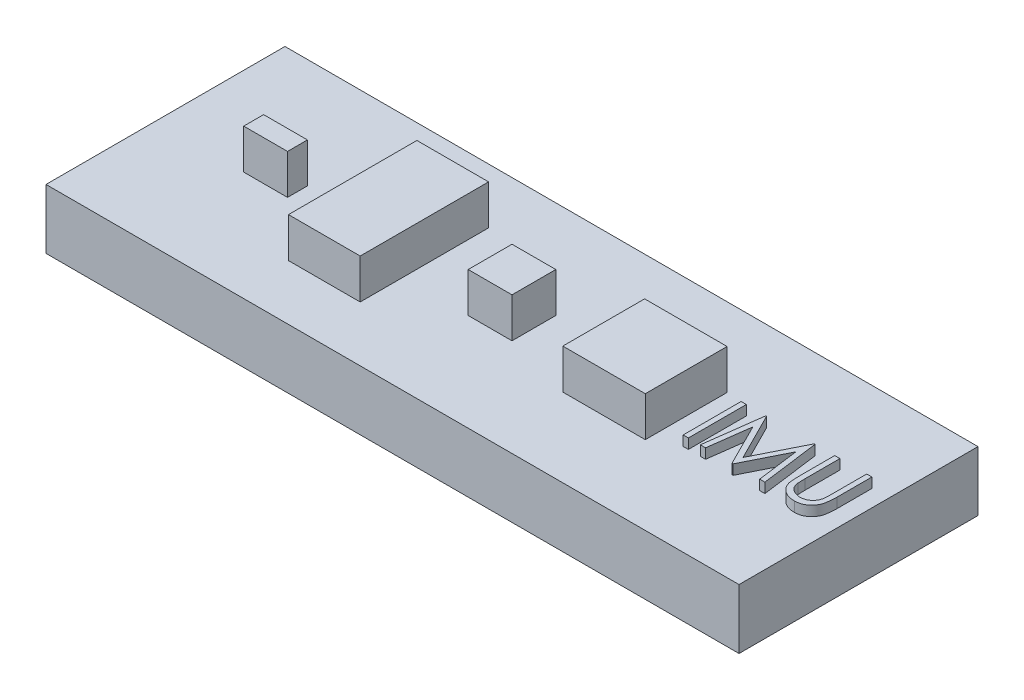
ISO-10303-21;
HEADER;
FILE_DESCRIPTION(('STEP AP214'),'2;1');
FILE_NAME('part.step','',(''),(''),'','','');
FILE_SCHEMA(('AUTOMOTIVE_DESIGN { 1 0 10303 214 1 1 1 1 }'));
ENDSEC;
DATA;
#1=APPLICATION_CONTEXT('core data for automotive mechanical design processes');
#2=APPLICATION_PROTOCOL_DEFINITION('international standard','automotive_design',2000,#1);
#3=PRODUCT_CONTEXT('',#1,'mechanical');
#4=PRODUCT('Part','Part','',(#3));
#5=PRODUCT_RELATED_PRODUCT_CATEGORY('part','',(#4));
#6=PRODUCT_DEFINITION_FORMATION('','',#4);
#7=PRODUCT_DEFINITION_CONTEXT('part definition',#1,'design');
#8=PRODUCT_DEFINITION('design','',#6,#7);
#9=PRODUCT_DEFINITION_SHAPE('','',#8);
#10=(LENGTH_UNIT() NAMED_UNIT(*) SI_UNIT(.MILLI.,.METRE.));
#11=(NAMED_UNIT(*) PLANE_ANGLE_UNIT() SI_UNIT($,.RADIAN.));
#12=(NAMED_UNIT(*) SI_UNIT($,.STERADIAN.) SOLID_ANGLE_UNIT());
#13=UNCERTAINTY_MEASURE_WITH_UNIT(LENGTH_MEASURE(1.E-05),#10,'distance_accuracy_value','');
#14=(GEOMETRIC_REPRESENTATION_CONTEXT(3) GLOBAL_UNCERTAINTY_ASSIGNED_CONTEXT((#13)) GLOBAL_UNIT_ASSIGNED_CONTEXT((#10,
#11,#12)) REPRESENTATION_CONTEXT('',''));
#15=CARTESIAN_POINT('',(0.,0.,0.));
#16=DIRECTION('',(0.,0.,1.));
#17=DIRECTION('',(1.,0.,0.));
#18=AXIS2_PLACEMENT_3D('',#15,#16,#17);
#19=CARTESIAN_POINT('',(0.,3.,0.));
#20=DIRECTION('',(0.,-1.,0.));
#21=DIRECTION('',(0.,0.,-1.));
#22=AXIS2_PLACEMENT_3D('',#19,#20,#21);
#23=PLANE('',#22);
#24=CARTESIAN_POINT('',(32.1450266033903,3.,-5.14314966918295));
#25=CARTESIAN_POINT('',(32.140721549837,3.,-5.15864354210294));
#26=CARTESIAN_POINT('',(32.1313837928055,3.,-5.19225009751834));
#27=CARTESIAN_POINT('',(32.1213841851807,3.,-5.24786939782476));
#28=CARTESIAN_POINT('',(32.1129780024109,3.,-5.31191096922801));
#29=CARTESIAN_POINT('',(32.1050736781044,3.,-5.38437919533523));
#30=CARTESIAN_POINT('',(32.1004095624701,3.,-5.46533024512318));
#31=CARTESIAN_POINT('',(32.0963204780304,3.,-5.5547290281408));
#32=CARTESIAN_POINT('',(32.0931093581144,3.,-5.65268364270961));
#33=CARTESIAN_POINT('',(32.0931282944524,3.,-5.72091587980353));
#34=CARTESIAN_POINT('',(32.0931381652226,3.,-5.75648266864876));
#35=B_SPLINE_CURVE_WITH_KNOTS('',3,(#24,#25,#26,#27,#28,#29,#30,#31,#32,#33,#34),.UNSPECIFIED.,
.F.,.F.,(4,1,1,1,1,1,1,1,4),(0.,0.0781298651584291,0.169465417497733,0.274335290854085,
0.39211016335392,0.523687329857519,0.668365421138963,0.827131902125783,1.),.UNSPECIFIED.);
#36=CARTESIAN_POINT('',(32.1450266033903,3.,-5.14314966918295));
#37=VERTEX_POINT('',#36);
#38=CARTESIAN_POINT('',(32.0931381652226,3.,-5.75648266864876));
#39=VERTEX_POINT('',#38);
#40=EDGE_CURVE('E376',#37,#39,#35,.T.);
#41=ORIENTED_EDGE('',*,*,#40,.T.);
#42=DIRECTION('',(0.,0.,-1.));
#43=VECTOR('',#42,1.);
#44=CARTESIAN_POINT('',(32.0931381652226,3.,-5.75648266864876));
#45=LINE('',#44,#43);
#46=CARTESIAN_POINT('',(32.0931381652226,3.,-7.51427638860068));
#47=VERTEX_POINT('',#46);
#48=EDGE_CURVE('E1010',#39,#47,#45,.T.);
#49=ORIENTED_EDGE('',*,*,#48,.T.);
#50=DIRECTION('',(1.,0.,0.));
#51=VECTOR('',#50,1.);
#52=CARTESIAN_POINT('',(32.0931381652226,3.,-7.51427638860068));
#53=LINE('',#52,#51);
#54=CARTESIAN_POINT('',(32.3543294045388,3.,-7.51427638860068));
#55=VERTEX_POINT('',#54);
#56=EDGE_CURVE('E355',#47,#55,#53,.T.);
#57=ORIENTED_EDGE('',*,*,#56,.T.);
#58=DIRECTION('',(0.,0.,1.));
#59=VECTOR('',#58,1.);
#60=CARTESIAN_POINT('',(32.3543294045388,3.,-7.51427638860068));
#61=LINE('',#60,#59);
#62=CARTESIAN_POINT('',(32.3543294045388,3.,-5.77047505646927));
#63=VERTEX_POINT('',#62);
#64=EDGE_CURVE('E48',#55,#63,#61,.T.);
#65=ORIENTED_EDGE('',*,*,#64,.T.);
#66=CARTESIAN_POINT('',(32.3543294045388,3.,-5.77047505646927));
#67=CARTESIAN_POINT('',(32.3542905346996,3.,-5.74579411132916));
#68=CARTESIAN_POINT('',(32.3542167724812,3.,-5.69895776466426));
#69=CARTESIAN_POINT('',(32.3547094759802,3.,-5.63229400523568));
#70=CARTESIAN_POINT('',(32.3560893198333,3.,-5.57302756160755));
#71=CARTESIAN_POINT('',(32.3569592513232,3.,-5.52092998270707));
#72=CARTESIAN_POINT('',(32.3588945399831,3.,-5.4762403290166));
#73=CARTESIAN_POINT('',(32.3604728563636,3.,-5.43871648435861));
#74=CARTESIAN_POINT('',(32.3625022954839,3.,-5.40853612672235));
#75=CARTESIAN_POINT('',(32.3649413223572,3.,-5.39092317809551));
#76=CARTESIAN_POINT('',(32.3659897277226,3.,-5.38335232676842));
#77=B_SPLINE_CURVE_WITH_KNOTS('',3,(#66,#67,#68,#69,#70,#71,#72,#73,#74,#75,#76),.UNSPECIFIED.,
.F.,.F.,(4,1,1,1,1,1,1,1,4),(0.,0.191078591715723,0.362604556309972,0.516098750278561,
0.65003802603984,0.765976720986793,0.862374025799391,0.940842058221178,1.),.UNSPECIFIED.);
#78=CARTESIAN_POINT('',(32.3659897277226,3.,-5.38335232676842));
#79=VERTEX_POINT('',#78);
#80=EDGE_CURVE('E997',#63,#79,#77,.T.);
#81=ORIENTED_EDGE('',*,*,#80,.T.);
#82=CARTESIAN_POINT('',(32.3659897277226,3.,-5.38335232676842));
#83=CARTESIAN_POINT('',(32.3702950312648,3.,-5.35603867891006));
#84=CARTESIAN_POINT('',(32.3786630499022,3.,-5.30295040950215));
#85=CARTESIAN_POINT('',(32.3999892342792,3.,-5.22735584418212));
#86=CARTESIAN_POINT('',(32.4297731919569,3.,-5.15922593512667));
#87=CARTESIAN_POINT('',(32.465066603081,3.,-5.09643470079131));
#88=CARTESIAN_POINT('',(32.5115772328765,3.,-5.04072985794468));
#89=CARTESIAN_POINT('',(32.5672938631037,3.,-4.98941367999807));
#90=CARTESIAN_POINT('',(32.6347970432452,3.,-4.94453355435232));
#91=CARTESIAN_POINT('',(32.7098530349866,3.,-4.90349600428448));
#92=CARTESIAN_POINT('',(32.7907503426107,3.,-4.87051259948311));
#93=CARTESIAN_POINT('',(32.8734155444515,3.,-4.84557168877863));
#94=CARTESIAN_POINT('',(32.9566060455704,3.,-4.83037191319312));
#95=CARTESIAN_POINT('',(33.0122999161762,3.,-4.8286119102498));
#96=CARTESIAN_POINT('',(33.039956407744,3.,-4.82773792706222));
#97=B_SPLINE_CURVE_WITH_KNOTS('',3,(#82,#83,#84,#85,#86,#87,#88,#89,#90,#91,#92,#93,#94,#95,
#96),.UNSPECIFIED.,.F.,.F.,(4,1,1,1,1,1,1,1,1,1,1,1,4),(0.,0.0863150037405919,0.16776646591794,
0.244432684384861,0.318134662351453,0.391884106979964,0.470068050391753,0.553904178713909,
0.644339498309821,0.736874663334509,0.826168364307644,0.91367859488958,1.),.UNSPECIFIED.);
#98=CARTESIAN_POINT('',(33.039956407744,3.,-4.82773792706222));
#99=VERTEX_POINT('',#98);
#100=EDGE_CURVE('E989',#79,#99,#97,.T.);
#101=ORIENTED_EDGE('',*,*,#100,.T.);
#102=CARTESIAN_POINT('',(33.039956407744,3.,-4.82773792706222));
#103=CARTESIAN_POINT('',(33.0637002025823,3.,-4.82863088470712));
#104=CARTESIAN_POINT('',(33.1110506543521,3.,-4.83041164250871));
#105=CARTESIAN_POINT('',(33.1814049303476,3.,-4.84143915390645));
#106=CARTESIAN_POINT('',(33.249924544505,3.,-4.8613136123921));
#107=CARTESIAN_POINT('',(33.3169478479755,3.,-4.88695834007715));
#108=CARTESIAN_POINT('',(33.3797720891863,3.,-4.92084190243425));
#109=CARTESIAN_POINT('',(33.4384323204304,3.,-4.95998354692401));
#110=CARTESIAN_POINT('',(33.4907898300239,3.,-5.00589401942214));
#111=CARTESIAN_POINT('',(33.5385688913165,3.,-5.05670186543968));
#112=CARTESIAN_POINT('',(33.5801753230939,3.,-5.11402859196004));
#113=CARTESIAN_POINT('',(33.6162404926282,3.,-5.17662594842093));
#114=CARTESIAN_POINT('',(33.6457819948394,3.,-5.2454359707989));
#115=CARTESIAN_POINT('',(33.6603702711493,3.,-5.29379414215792));
#116=CARTESIAN_POINT('',(33.6678648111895,3.,-5.31863753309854));
#117=B_SPLINE_CURVE_WITH_KNOTS('',3,(#102,#103,#104,#105,#106,#107,#108,#109,#110,#111,#112,
#113,#114,#115,#116),.UNSPECIFIED.,.F.,.F.,(4,1,1,1,1,1,1,1,1,1,1,1,4),(0.,0.0828906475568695,
0.165302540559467,0.247761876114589,0.331527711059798,0.415279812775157,0.496366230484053,
0.577151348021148,0.65778254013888,0.739321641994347,0.823793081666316,0.909475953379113,1.),.UNSPECIFIED.);
#118=CARTESIAN_POINT('',(33.6678648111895,3.,-5.31863753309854));
#119=VERTEX_POINT('',#118);
#120=EDGE_CURVE('E981',#99,#119,#117,.T.);
#121=ORIENTED_EDGE('',*,*,#120,.T.);
#122=CARTESIAN_POINT('',(33.6678648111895,3.,-5.31863753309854));
#123=CARTESIAN_POINT('',(33.6703595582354,3.,-5.32890596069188));
#124=CARTESIAN_POINT('',(33.6759188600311,3.,-5.35178815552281));
#125=CARTESIAN_POINT('',(33.6811135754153,3.,-5.39047282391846));
#126=CARTESIAN_POINT('',(33.686524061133,3.,-5.43611594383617));
#127=CARTESIAN_POINT('',(33.6902781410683,3.,-5.48904545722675));
#128=CARTESIAN_POINT('',(33.6939379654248,3.,-5.5490840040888));
#129=CARTESIAN_POINT('',(33.6961274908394,3.,-5.61654435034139));
#130=CARTESIAN_POINT('',(33.6971395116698,3.,-5.69118153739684));
#131=CARTESIAN_POINT('',(33.697441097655,3.,-5.74326732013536));
#132=CARTESIAN_POINT('',(33.6975986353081,3.,-5.77047505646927));
#133=B_SPLINE_CURVE_WITH_KNOTS('',3,(#122,#123,#124,#125,#126,#127,#128,#129,#130,#131,#132),
.UNSPECIFIED.,.F.,.F.,(4,1,1,1,1,1,1,1,4),(0.,0.0698351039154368,0.155620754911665,
0.257801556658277,0.373811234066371,0.506402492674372,0.655564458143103,0.820079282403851,1.),.UNSPECIFIED.);
#134=CARTESIAN_POINT('',(33.6975986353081,3.,-5.77047505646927));
#135=VERTEX_POINT('',#134);
#136=EDGE_CURVE('E976',#119,#135,#133,.T.);
#137=ORIENTED_EDGE('',*,*,#136,.T.);
#138=DIRECTION('',(0.,0.,-1.));
#139=VECTOR('',#138,1.);
#140=CARTESIAN_POINT('',(33.6975986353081,3.,-5.77047505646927));
#141=LINE('',#140,#139);
#142=CARTESIAN_POINT('',(33.6975986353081,3.,-7.51427638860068));
#143=VERTEX_POINT('',#142);
#144=EDGE_CURVE('E973',#135,#143,#141,.T.);
#145=ORIENTED_EDGE('',*,*,#144,.T.);
#146=DIRECTION('',(1.,0.,0.));
#147=VECTOR('',#146,1.);
#148=CARTESIAN_POINT('',(33.6975986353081,3.,-7.51427638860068));
#149=LINE('',#148,#147);
#150=CARTESIAN_POINT('',(33.9587898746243,3.,-7.51427638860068));
#151=VERTEX_POINT('',#150);
#152=EDGE_CURVE('E970',#143,#151,#149,.T.);
#153=ORIENTED_EDGE('',*,*,#152,.T.);
#154=DIRECTION('',(0.,0.,1.));
#155=VECTOR('',#154,1.);
#156=CARTESIAN_POINT('',(33.9587898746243,3.,-7.51427638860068));
#157=LINE('',#156,#155);
#158=CARTESIAN_POINT('',(33.9587898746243,3.,-5.75648266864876));
#159=VERTEX_POINT('',#158);
#160=EDGE_CURVE('E964',#151,#159,#157,.T.);
#161=ORIENTED_EDGE('',*,*,#160,.T.);
#162=CARTESIAN_POINT('',(33.9587898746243,3.,-5.75648266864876));
#163=CARTESIAN_POINT('',(33.9585785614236,3.,-5.72480205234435));
#164=CARTESIAN_POINT('',(33.9581661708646,3.,-5.66297540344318));
#165=CARTESIAN_POINT('',(33.9545900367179,3.,-5.57237716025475));
#166=CARTESIAN_POINT('',(33.948888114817,3.,-5.48643423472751));
#167=CARTESIAN_POINT('',(33.940832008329,3.,-5.4051350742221));
#168=CARTESIAN_POINT('',(33.9301574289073,3.,-5.32877059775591));
#169=CARTESIAN_POINT('',(33.9182869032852,3.,-5.25667145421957));
#170=CARTESIAN_POINT('',(33.9031697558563,3.,-5.18935518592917));
#171=CARTESIAN_POINT('',(33.8855131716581,3.,-5.12629691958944));
#172=CARTESIAN_POINT('',(33.8653285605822,3.,-5.06627122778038));
#173=CARTESIAN_POINT('',(33.8391837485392,3.,-5.00930305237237));
#174=CARTESIAN_POINT('',(33.8097265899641,3.,-4.95366054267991));
#175=CARTESIAN_POINT('',(33.7747894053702,3.,-4.9001852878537));
#176=CARTESIAN_POINT('',(33.7355308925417,3.,-4.8486405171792));
#177=CARTESIAN_POINT('',(33.6910832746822,3.,-4.7993388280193));
#178=CARTESIAN_POINT('',(33.6429165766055,3.,-4.75149237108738));
#179=CARTESIAN_POINT('',(33.5902300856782,3.,-4.70632847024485));
#180=CARTESIAN_POINT('',(33.5338922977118,3.,-4.66491018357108));
#181=CARTESIAN_POINT('',(33.4740707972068,3.,-4.62849025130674));
#182=CARTESIAN_POINT('',(33.4112251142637,3.,-4.59770335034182));
#183=CARTESIAN_POINT('',(33.3455186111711,3.,-4.57236116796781));
#184=CARTESIAN_POINT('',(33.2769232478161,3.,-4.55330658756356));
#185=CARTESIAN_POINT('',(33.2054372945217,3.,-4.53910778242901));
#186=CARTESIAN_POINT('',(33.1308980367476,3.,-4.53103986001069));
#187=CARTESIAN_POINT('',(33.0802030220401,3.,-4.52984082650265));
#188=CARTESIAN_POINT('',(33.0545318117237,3.,-4.52923365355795));
#189=B_SPLINE_CURVE_WITH_KNOTS('',3,(#162,#163,#164,#165,#166,#167,#168,#169,#170,#171,#172,
#173,#174,#175,#176,#177,#178,#179,#180,#181,#182,#183,#184,#185,#186,#187,#188),.UNSPECIFIED.,
.F.,.F.,(4,1,1,1,1,1,1,1,1,1,1,1,1,1,1,1,1,1,1,1,1,1,1,1,4),(0.,0.0548580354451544,
0.107058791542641,0.156978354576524,0.203992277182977,0.248491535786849,0.290483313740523,
0.33048900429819,0.367885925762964,0.403858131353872,0.440009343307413,0.476295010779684,
0.51279229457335,0.550484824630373,0.588381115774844,0.627645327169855,0.667979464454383,
0.708432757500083,0.748602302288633,0.789087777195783,0.829461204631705,0.870371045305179,
0.912214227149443,0.955546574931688,1.),.UNSPECIFIED.);
#190=CARTESIAN_POINT('',(33.0545318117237,3.,-4.52923365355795));
#191=VERTEX_POINT('',#190);
#192=EDGE_CURVE('E956',#159,#191,#189,.T.);
#193=ORIENTED_EDGE('',*,*,#192,.T.);
#194=CARTESIAN_POINT('',(33.0545318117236,3.,-4.52923365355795));
#195=CARTESIAN_POINT('',(33.0265343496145,3.,-4.52988622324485));
#196=CARTESIAN_POINT('',(32.9716034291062,3.,-4.53116656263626));
#197=CARTESIAN_POINT('',(32.890662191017,3.,-4.5385030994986));
#198=CARTESIAN_POINT('',(32.8130669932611,3.,-4.55232208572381));
#199=CARTESIAN_POINT('',(32.7379983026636,3.,-4.56991758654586));
#200=CARTESIAN_POINT('',(32.6664781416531,3.,-4.59418525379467));
#201=CARTESIAN_POINT('',(32.5975482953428,3.,-4.62253946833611));
#202=CARTESIAN_POINT('',(32.5323893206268,3.,-4.65736240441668));
#203=CARTESIAN_POINT('',(32.4699441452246,3.,-4.69610702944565));
#204=CARTESIAN_POINT('',(32.4118815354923,3.,-4.73970061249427));
#205=CARTESIAN_POINT('',(32.358581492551,3.,-4.78721538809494));
#206=CARTESIAN_POINT('',(32.309956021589,3.,-4.83789021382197));
#207=CARTESIAN_POINT('',(32.2668247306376,3.,-4.89227373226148));
#208=CARTESIAN_POINT('',(32.2284730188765,3.,-4.94994297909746));
#209=CARTESIAN_POINT('',(32.1954354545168,3.,-5.01106109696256));
#210=CARTESIAN_POINT('',(32.1670686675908,3.,-5.07560442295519));
#211=CARTESIAN_POINT('',(32.1524279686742,3.,-5.12046907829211));
#212=CARTESIAN_POINT('',(32.1450266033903,3.,-5.14314966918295));
#213=B_SPLINE_CURVE_WITH_KNOTS('',3,(#194,#195,#196,#197,#198,#199,#200,#201,#202,#203,#204,
#205,#206,#207,#208,#209,#210,#211,#212),.UNSPECIFIED.,.F.,.F.,(4,1,1,1,1,1,1,1,1,1,1,1,1,1,1,1,
4),(0.,0.0711745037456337,0.139644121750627,0.206317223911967,0.271373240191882,
0.335418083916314,0.398076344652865,0.460607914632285,0.522969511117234,0.58471572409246,
0.644894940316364,0.70429056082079,0.762998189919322,0.821087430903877,0.880103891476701,
0.939388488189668,1.),.UNSPECIFIED.);
#214=EDGE_CURVE('E379',#191,#37,#213,.T.);
#215=ORIENTED_EDGE('',*,*,#214,.T.);
#216=EDGE_LOOP('',(#41,#49,#57,#65,#81,#101,#121,#137,#145,#153,#161,#193,#215));
#217=FACE_BOUND('',#216,.T.);
#218=DIRECTION('',(-0.131351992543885,0.,0.991335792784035));
#219=VECTOR('',#218,1.);
#220=CARTESIAN_POINT('',(28.7909346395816,3.,-6.70271789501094));
#221=LINE('',#220,#219);
#222=CARTESIAN_POINT('',(28.7909346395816,3.,-6.70271789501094));
#223=VERTEX_POINT('',#222);
#224=CARTESIAN_POINT('',(28.5128359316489,3.,-4.60385972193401));
#225=VERTEX_POINT('',#224);
#226=EDGE_CURVE('E850',#223,#225,#221,.T.);
#227=ORIENTED_EDGE('',*,*,#226,.T.);
#228=DIRECTION('',(-1.,0.,0.));
#229=VECTOR('',#228,1.);
#230=CARTESIAN_POINT('',(28.5128359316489,3.,-4.60385972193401));
#231=LINE('',#230,#229);
#232=CARTESIAN_POINT('',(28.2498956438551,3.,-4.60385972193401));
#233=VERTEX_POINT('',#232);
#234=EDGE_CURVE('E885',#225,#233,#231,.T.);
#235=ORIENTED_EDGE('',*,*,#234,.T.);
#236=DIRECTION('',(0.130875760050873,0.,-0.991398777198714));
#237=VECTOR('',#236,1.);
#238=CARTESIAN_POINT('',(28.2498956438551,3.,-4.60385972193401));
#239=LINE('',#238,#237);
#240=CARTESIAN_POINT('',(28.63410329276,3.,-7.51427638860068));
#241=VERTEX_POINT('',#240);
#242=EDGE_CURVE('E882',#233,#241,#239,.T.);
#243=ORIENTED_EDGE('',*,*,#242,.T.);
#244=DIRECTION('',(1.,0.,0.));
#245=VECTOR('',#244,1.);
#246=CARTESIAN_POINT('',(28.63410329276,3.,-7.51427638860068));
#247=LINE('',#246,#245);
#248=CARTESIAN_POINT('',(28.671416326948,3.,-7.51427638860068));
#249=VERTEX_POINT('',#248);
#250=EDGE_CURVE('E56',#241,#249,#247,.T.);
#251=ORIENTED_EDGE('',*,*,#250,.T.);
#252=DIRECTION('',(0.449480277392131,0.,0.893290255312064));
#253=VECTOR('',#252,1.);
#254=CARTESIAN_POINT('',(28.671416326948,3.,-7.51427638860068));
#255=LINE('',#254,#253);
#256=CARTESIAN_POINT('',(29.8730126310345,3.,-5.12624220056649));
#257=VERTEX_POINT('',#256);
#258=EDGE_CURVE('E878',#249,#257,#255,.T.);
#259=ORIENTED_EDGE('',*,*,#258,.T.);
#260=DIRECTION('',(0.448609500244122,0.,-0.893727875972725));
#261=VECTOR('',#260,1.);
#262=CARTESIAN_POINT('',(29.8730126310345,3.,-5.12624220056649));
#263=LINE('',#262,#261);
#264=CARTESIAN_POINT('',(31.0716938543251,3.,-7.51427638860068));
#265=VERTEX_POINT('',#264);
#266=EDGE_CURVE('E875',#257,#265,#263,.T.);
#267=ORIENTED_EDGE('',*,*,#266,.T.);
#268=DIRECTION('',(1.,0.,0.));
#269=VECTOR('',#268,1.);
#270=CARTESIAN_POINT('',(31.0716938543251,3.,-7.51427638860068));
#271=LINE('',#270,#269);
#272=CARTESIAN_POINT('',(31.1095899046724,3.,-7.51427638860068));
#273=VERTEX_POINT('',#272);
#274=EDGE_CURVE('E872',#265,#273,#271,.T.);
#275=ORIENTED_EDGE('',*,*,#274,.T.);
#276=DIRECTION('',(0.131656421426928,0.,0.991295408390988));
#277=VECTOR('',#276,1.);
#278=CARTESIAN_POINT('',(31.1095899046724,3.,-7.51427638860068));
#279=LINE('',#278,#277);
#280=CARTESIAN_POINT('',(31.496129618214,3.,-4.60385972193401));
#281=VERTEX_POINT('',#280);
#282=EDGE_CURVE('E869',#273,#281,#279,.T.);
#283=ORIENTED_EDGE('',*,*,#282,.T.);
#284=DIRECTION('',(-1.,0.,0.));
#285=VECTOR('',#284,1.);
#286=CARTESIAN_POINT('',(31.496129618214,3.,-4.60385972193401));
#287=LINE('',#286,#285);
#288=CARTESIAN_POINT('',(31.2337723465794,3.,-4.60385972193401));
#289=VERTEX_POINT('',#288);
#290=EDGE_CURVE('E866',#281,#289,#287,.T.);
#291=ORIENTED_EDGE('',*,*,#290,.T.);
#292=DIRECTION('',(-0.131910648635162,0.,-0.991261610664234));
#293=VECTOR('',#292,1.);
#294=CARTESIAN_POINT('',(31.2337723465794,3.,-4.60385972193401));
#295=LINE('',#294,#293);
#296=CARTESIAN_POINT('',(30.9550906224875,3.,-6.69805376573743));
#297=VERTEX_POINT('',#296);
#298=EDGE_CURVE('E863',#289,#297,#295,.T.);
#299=ORIENTED_EDGE('',*,*,#298,.T.);
#300=DIRECTION('',(-0.448407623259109,0.,0.893829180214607));
#301=VECTOR('',#300,1.);
#302=CARTESIAN_POINT('',(30.9550906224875,3.,-6.69805376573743));
#303=LINE('',#302,#301);
#304=CARTESIAN_POINT('',(29.9044955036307,3.,-4.60385972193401));
#305=VERTEX_POINT('',#304);
#306=EDGE_CURVE('E860',#297,#305,#303,.T.);
#307=ORIENTED_EDGE('',*,*,#306,.T.);
#308=DIRECTION('',(-1.,0.,0.));
#309=VECTOR('',#308,1.);
#310=CARTESIAN_POINT('',(29.9044955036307,3.,-4.60385972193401));
#311=LINE('',#310,#309);
#312=CARTESIAN_POINT('',(29.8456108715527,3.,-4.60385972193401));
#313=VERTEX_POINT('',#312);
#314=EDGE_CURVE('E857',#305,#313,#311,.T.);
#315=ORIENTED_EDGE('',*,*,#314,.T.);
#316=DIRECTION('',(-0.448999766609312,0.,-0.893531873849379));
#317=VECTOR('',#316,1.);
#318=CARTESIAN_POINT('',(29.8456108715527,3.,-4.60385972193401));
#319=LINE('',#318,#317);
#320=EDGE_CURVE('E854',#313,#223,#319,.T.);
#321=ORIENTED_EDGE('',*,*,#320,.T.);
#322=EDGE_LOOP('',(#227,#235,#243,#251,#259,#267,#275,#283,#291,#299,#307,#315,#321));
#323=FACE_BOUND('',#322,.T.);
#324=DIRECTION('',(-1.,0.,0.));
#325=VECTOR('',#324,1.);
#326=CARTESIAN_POINT('',(27.6528870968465,3.,-4.60385972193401));
#327=LINE('',#326,#325);
#328=CARTESIAN_POINT('',(27.6528870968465,3.,-4.60385972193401));
#329=VERTEX_POINT('',#328);
#330=CARTESIAN_POINT('',(27.3916958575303,3.,-4.60385972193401));
#331=VERTEX_POINT('',#330);
#332=EDGE_CURVE('E800',#329,#331,#327,.T.);
#333=ORIENTED_EDGE('',*,*,#332,.T.);
#334=DIRECTION('',(0.,0.,-1.));
#335=VECTOR('',#334,1.);
#336=CARTESIAN_POINT('',(27.3916958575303,3.,-4.60385972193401));
#337=LINE('',#336,#335);
#338=CARTESIAN_POINT('',(27.3916958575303,3.,-7.51427638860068));
#339=VERTEX_POINT('',#338);
#340=EDGE_CURVE('E810',#331,#339,#337,.T.);
#341=ORIENTED_EDGE('',*,*,#340,.T.);
#342=DIRECTION('',(1.,0.,0.));
#343=VECTOR('',#342,1.);
#344=CARTESIAN_POINT('',(27.3916958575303,3.,-7.51427638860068));
#345=LINE('',#344,#343);
#346=CARTESIAN_POINT('',(27.6528870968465,3.,-7.51427638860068));
#347=VERTEX_POINT('',#346);
#348=EDGE_CURVE('E807',#339,#347,#345,.T.);
#349=ORIENTED_EDGE('',*,*,#348,.T.);
#350=DIRECTION('',(0.,0.,1.));
#351=VECTOR('',#350,1.);
#352=CARTESIAN_POINT('',(27.6528870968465,3.,-7.51427638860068));
#353=LINE('',#352,#351);
#354=EDGE_CURVE('E804',#347,#329,#353,.T.);
#355=ORIENTED_EDGE('',*,*,#354,.T.);
#356=EDGE_LOOP('',(#333,#341,#349,#355));
#357=FACE_BOUND('',#356,.T.);
#358=DIRECTION('',(0.,0.,-1.));
#359=VECTOR('',#358,1.);
#360=CARTESIAN_POINT('',(13.001026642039,3.,-2.77582497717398));
#361=LINE('',#360,#359);
#362=CARTESIAN_POINT('',(13.001026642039,3.,-2.77582497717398));
#363=VERTEX_POINT('',#362);
#364=CARTESIAN_POINT('',(13.001026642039,3.,-9.22417502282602));
#365=VERTEX_POINT('',#364);
#366=EDGE_CURVE('E676',#363,#365,#361,.T.);
#367=ORIENTED_EDGE('',*,*,#366,.F.);
#368=DIRECTION('',(1.,0.,0.));
#369=VECTOR('',#368,1.);
#370=CARTESIAN_POINT('',(9.39942211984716,3.,-2.77582497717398));
#371=LINE('',#370,#369);
#372=CARTESIAN_POINT('',(9.39942211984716,3.,-2.77582497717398));
#373=VERTEX_POINT('',#372);
#374=EDGE_CURVE('E681',#373,#363,#371,.T.);
#375=ORIENTED_EDGE('',*,*,#374,.F.);
#376=DIRECTION('',(0.,0.,1.));
#377=VECTOR('',#376,1.);
#378=CARTESIAN_POINT('',(9.39942211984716,3.,-2.77582497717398));
#379=LINE('',#378,#377);
#380=CARTESIAN_POINT('',(9.39942211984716,3.,-9.22417502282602));
#381=VERTEX_POINT('',#380);
#382=EDGE_CURVE('E693',#381,#373,#379,.T.);
#383=ORIENTED_EDGE('',*,*,#382,.F.);
#384=DIRECTION('',(-1.,0.,0.));
#385=VECTOR('',#384,1.);
#386=CARTESIAN_POINT('',(9.39942211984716,3.,-9.22417502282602));
#387=LINE('',#386,#385);
#388=EDGE_CURVE('E690',#365,#381,#387,.T.);
#389=ORIENTED_EDGE('',*,*,#388,.F.);
#390=EDGE_LOOP('',(#367,#375,#383,#389));
#391=FACE_BOUND('',#390,.T.);
#392=DIRECTION('',(0.,0.,-1.));
#393=VECTOR('',#392,1.);
#394=CARTESIAN_POINT('',(26.1468831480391,3.,-3.94634644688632));
#395=LINE('',#394,#393);
#396=CARTESIAN_POINT('',(26.1468831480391,3.,-3.94634644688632));
#397=VERTEX_POINT('',#396);
#398=CARTESIAN_POINT('',(26.1468831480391,3.,-8.05365355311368));
#399=VERTEX_POINT('',#398);
#400=EDGE_CURVE('E739',#397,#399,#395,.T.);
#401=ORIENTED_EDGE('',*,*,#400,.F.);
#402=DIRECTION('',(1.,0.,0.));
#403=VECTOR('',#402,1.);
#404=CARTESIAN_POINT('',(22.0050379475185,3.,-3.94634644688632));
#405=LINE('',#404,#403);
#406=CARTESIAN_POINT('',(22.0050379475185,3.,-3.94634644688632));
#407=VERTEX_POINT('',#406);
#408=EDGE_CURVE('E744',#407,#397,#405,.T.);
#409=ORIENTED_EDGE('',*,*,#408,.F.);
#410=DIRECTION('',(0.,0.,1.));
#411=VECTOR('',#410,1.);
#412=CARTESIAN_POINT('',(22.0050379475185,3.,-3.94634644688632));
#413=LINE('',#412,#411);
#414=CARTESIAN_POINT('',(22.0050379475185,3.,-8.05365355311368));
#415=VERTEX_POINT('',#414);
#416=EDGE_CURVE('E754',#415,#407,#413,.T.);
#417=ORIENTED_EDGE('',*,*,#416,.F.);
#418=DIRECTION('',(-1.,0.,0.));
#419=VECTOR('',#418,1.);
#420=CARTESIAN_POINT('',(22.0050379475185,3.,-8.05365355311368));
#421=LINE('',#420,#419);
#422=EDGE_CURVE('E752',#399,#415,#421,.T.);
#423=ORIENTED_EDGE('',*,*,#422,.F.);
#424=EDGE_LOOP('',(#401,#409,#417,#423));
#425=FACE_BOUND('',#424,.T.);
#426=DIRECTION('',(0.,0.,1.));
#427=VECTOR('',#426,1.);
#428=CARTESIAN_POINT('',(0.,3.,0.));
#429=LINE('',#428,#427);
#430=CARTESIAN_POINT('',(0.,3.,-12.));
#431=VERTEX_POINT('',#430);
#432=CARTESIAN_POINT('',(0.,3.,0.));
#433=VERTEX_POINT('',#432);
#434=EDGE_CURVE('E607',#431,#433,#429,.T.);
#435=ORIENTED_EDGE('',*,*,#434,.T.);
#436=DIRECTION('',(1.,0.,0.));
#437=VECTOR('',#436,1.);
#438=CARTESIAN_POINT('',(0.,3.,0.));
#439=LINE('',#438,#437);
#440=CARTESIAN_POINT('',(34.8,3.,0.));
#441=VERTEX_POINT('',#440);
#442=EDGE_CURVE('E621',#433,#441,#439,.T.);
#443=ORIENTED_EDGE('',*,*,#442,.T.);
#444=DIRECTION('',(0.,0.,-1.));
#445=VECTOR('',#444,1.);
#446=CARTESIAN_POINT('',(34.8,3.,0.));
#447=LINE('',#446,#445);
#448=CARTESIAN_POINT('',(34.8,3.,-12.));
#449=VERTEX_POINT('',#448);
#450=EDGE_CURVE('E602',#441,#449,#447,.T.);
#451=ORIENTED_EDGE('',*,*,#450,.T.);
#452=DIRECTION('',(-1.,0.,0.));
#453=VECTOR('',#452,1.);
#454=CARTESIAN_POINT('',(0.,3.,-12.));
#455=LINE('',#454,#453);
#456=EDGE_CURVE('E614',#449,#431,#455,.T.);
#457=ORIENTED_EDGE('',*,*,#456,.T.);
#458=EDGE_LOOP('',(#435,#443,#451,#457));
#459=FACE_BOUND('',#458,.T.);
#460=DIRECTION('',(0.,0.,-1.));
#461=VECTOR('',#460,1.);
#462=CARTESIAN_POINT('',(18.5,3.,-4.9));
#463=LINE('',#462,#461);
#464=CARTESIAN_POINT('',(18.5,3.,-4.9));
#465=VERTEX_POINT('',#464);
#466=CARTESIAN_POINT('',(18.5,3.,-7.1));
#467=VERTEX_POINT('',#466);
#468=EDGE_CURVE('E639',#465,#467,#463,.T.);
#469=ORIENTED_EDGE('',*,*,#468,.F.);
#470=DIRECTION('',(1.,0.,0.));
#471=VECTOR('',#470,1.);
#472=CARTESIAN_POINT('',(16.3,3.,-4.9));
#473=LINE('',#472,#471);
#474=CARTESIAN_POINT('',(16.3,3.,-4.9));
#475=VERTEX_POINT('',#474);
#476=EDGE_CURVE('E713',#475,#465,#473,.T.);
#477=ORIENTED_EDGE('',*,*,#476,.F.);
#478=DIRECTION('',(0.,0.,1.));
#479=VECTOR('',#478,1.);
#480=CARTESIAN_POINT('',(16.3,3.,-4.9));
#481=LINE('',#480,#479);
#482=CARTESIAN_POINT('',(16.3,3.,-7.1));
#483=VERTEX_POINT('',#482);
#484=EDGE_CURVE('E724',#483,#475,#481,.T.);
#485=ORIENTED_EDGE('',*,*,#484,.F.);
#486=DIRECTION('',(-1.,0.,0.));
#487=VECTOR('',#486,1.);
#488=CARTESIAN_POINT('',(16.3,3.,-7.1));
#489=LINE('',#488,#487);
#490=EDGE_CURVE('E721',#467,#483,#489,.T.);
#491=ORIENTED_EDGE('',*,*,#490,.F.);
#492=EDGE_LOOP('',(#469,#477,#485,#491));
#493=FACE_BOUND('',#492,.T.);
#494=DIRECTION('',(0.,0.,-1.));
#495=VECTOR('',#494,1.);
#496=CARTESIAN_POINT('',(6.62769725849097,3.,-5.49999999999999));
#497=LINE('',#496,#495);
#498=CARTESIAN_POINT('',(6.62769725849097,3.,-5.49999999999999));
#499=VERTEX_POINT('',#498);
#500=CARTESIAN_POINT('',(6.62769725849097,3.,-6.49999999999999));
#501=VERTEX_POINT('',#500);
#502=EDGE_CURVE('E642',#499,#501,#497,.T.);
#503=ORIENTED_EDGE('',*,*,#502,.F.);
#504=DIRECTION('',(1.,0.,0.));
#505=VECTOR('',#504,1.);
#506=CARTESIAN_POINT('',(4.42769725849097,3.,-5.49999999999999));
#507=LINE('',#506,#505);
#508=CARTESIAN_POINT('',(4.42769725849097,3.,-5.49999999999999));
#509=VERTEX_POINT('',#508);
#510=EDGE_CURVE('E644',#509,#499,#507,.T.);
#511=ORIENTED_EDGE('',*,*,#510,.F.);
#512=DIRECTION('',(0.,0.,1.));
#513=VECTOR('',#512,1.);
#514=CARTESIAN_POINT('',(4.42769725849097,3.,-5.49999999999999));
#515=LINE('',#514,#513);
#516=CARTESIAN_POINT('',(4.42769725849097,3.,-6.49999999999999));
#517=VERTEX_POINT('',#516);
#518=EDGE_CURVE('E661',#517,#509,#515,.T.);
#519=ORIENTED_EDGE('',*,*,#518,.F.);
#520=DIRECTION('',(-1.,0.,0.));
#521=VECTOR('',#520,1.);
#522=CARTESIAN_POINT('',(4.42769725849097,3.,-6.49999999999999));
#523=LINE('',#522,#521);
#524=EDGE_CURVE('E647',#501,#517,#523,.T.);
#525=ORIENTED_EDGE('',*,*,#524,.F.);
#526=EDGE_LOOP('',(#503,#511,#519,#525));
#527=FACE_BOUND('',#526,.T.);
#528=ADVANCED_FACE('F33',(#217,#323,#357,#391,#425,#459,#493,#527),#23,.F.);
#529=CARTESIAN_POINT('',(0.,3.,0.));
#530=DIRECTION('',(1.,0.,0.));
#531=DIRECTION('',(0.,0.,-1.));
#532=AXIS2_PLACEMENT_3D('',#529,#530,#531);
#533=PLANE('',#532);
#534=DIRECTION('',(0.,0.,1.));
#535=VECTOR('',#534,1.);
#536=CARTESIAN_POINT('',(0.,0.,0.));
#537=LINE('',#536,#535);
#538=CARTESIAN_POINT('',(0.,0.,-12.));
#539=VERTEX_POINT('',#538);
#540=CARTESIAN_POINT('',(0.,0.,0.));
#541=VERTEX_POINT('',#540);
#542=EDGE_CURVE('E598',#539,#541,#537,.T.);
#543=ORIENTED_EDGE('',*,*,#542,.T.);
#544=DIRECTION('',(0.,-1.,0.));
#545=VECTOR('',#544,1.);
#546=CARTESIAN_POINT('',(0.,3.,0.));
#547=LINE('',#546,#545);
#548=EDGE_CURVE('E11',#433,#541,#547,.T.);
#549=ORIENTED_EDGE('',*,*,#548,.F.);
#550=ORIENTED_EDGE('',*,*,#434,.F.);
#551=DIRECTION('',(0.,-1.,0.));
#552=VECTOR('',#551,1.);
#553=CARTESIAN_POINT('',(0.,3.,-12.));
#554=LINE('',#553,#552);
#555=EDGE_CURVE('E611',#431,#539,#554,.T.);
#556=ORIENTED_EDGE('',*,*,#555,.T.);
#557=EDGE_LOOP('',(#543,#549,#550,#556));
#558=FACE_BOUND('',#557,.T.);
#559=ADVANCED_FACE('F35',(#558),#533,.F.);
#560=CARTESIAN_POINT('',(0.,3.,0.));
#561=DIRECTION('',(0.,0.,-1.));
#562=DIRECTION('',(-1.,0.,0.));
#563=AXIS2_PLACEMENT_3D('',#560,#561,#562);
#564=PLANE('',#563);
#565=DIRECTION('',(1.,0.,0.));
#566=VECTOR('',#565,1.);
#567=CARTESIAN_POINT('',(0.,0.,0.));
#568=LINE('',#567,#566);
#569=CARTESIAN_POINT('',(34.8,0.,0.));
#570=VERTEX_POINT('',#569);
#571=EDGE_CURVE('E590',#541,#570,#568,.T.);
#572=ORIENTED_EDGE('',*,*,#571,.T.);
#573=DIRECTION('',(0.,-1.,0.));
#574=VECTOR('',#573,1.);
#575=CARTESIAN_POINT('',(34.8,3.,0.));
#576=LINE('',#575,#574);
#577=EDGE_CURVE('E41',#441,#570,#576,.T.);
#578=ORIENTED_EDGE('',*,*,#577,.F.);
#579=ORIENTED_EDGE('',*,*,#442,.F.);
#580=ORIENTED_EDGE('',*,*,#548,.T.);
#581=EDGE_LOOP('',(#572,#578,#579,#580));
#582=FACE_BOUND('',#581,.T.);
#583=ADVANCED_FACE('F581',(#582),#564,.F.);
#584=CARTESIAN_POINT('',(34.8,3.,0.));
#585=DIRECTION('',(-1.,0.,0.));
#586=DIRECTION('',(0.,0.,1.));
#587=AXIS2_PLACEMENT_3D('',#584,#585,#586);
#588=PLANE('',#587);
#589=DIRECTION('',(0.,0.,-1.));
#590=VECTOR('',#589,1.);
#591=CARTESIAN_POINT('',(34.8,0.,0.));
#592=LINE('',#591,#590);
#593=CARTESIAN_POINT('',(34.8,0.,-12.));
#594=VERTEX_POINT('',#593);
#595=EDGE_CURVE('E597',#570,#594,#592,.T.);
#596=ORIENTED_EDGE('',*,*,#595,.T.);
#597=DIRECTION('',(0.,-1.,0.));
#598=VECTOR('',#597,1.);
#599=CARTESIAN_POINT('',(34.8,3.,-12.));
#600=LINE('',#599,#598);
#601=EDGE_CURVE('E603',#449,#594,#600,.T.);
#602=ORIENTED_EDGE('',*,*,#601,.F.);
#603=ORIENTED_EDGE('',*,*,#450,.F.);
#604=ORIENTED_EDGE('',*,*,#577,.T.);
#605=EDGE_LOOP('',(#596,#602,#603,#604));
#606=FACE_BOUND('',#605,.T.);
#607=ADVANCED_FACE('F578',(#606),#588,.F.);
#608=CARTESIAN_POINT('',(0.,3.,-12.));
#609=DIRECTION('',(0.,0.,1.));
#610=DIRECTION('',(1.,0.,0.));
#611=AXIS2_PLACEMENT_3D('',#608,#609,#610);
#612=PLANE('',#611);
#613=DIRECTION('',(-1.,0.,0.));
#614=VECTOR('',#613,1.);
#615=CARTESIAN_POINT('',(0.,0.,-12.));
#616=LINE('',#615,#614);
#617=EDGE_CURVE('E605',#594,#539,#616,.T.);
#618=ORIENTED_EDGE('',*,*,#617,.T.);
#619=ORIENTED_EDGE('',*,*,#555,.F.);
#620=ORIENTED_EDGE('',*,*,#456,.F.);
#621=ORIENTED_EDGE('',*,*,#601,.T.);
#622=EDGE_LOOP('',(#618,#619,#620,#621));
#623=FACE_BOUND('',#622,.T.);
#624=ADVANCED_FACE('F574',(#623),#612,.F.);
#625=CARTESIAN_POINT('',(0.,0.,0.));
#626=DIRECTION('',(0.,-1.,0.));
#627=DIRECTION('',(0.,0.,-1.));
#628=AXIS2_PLACEMENT_3D('',#625,#626,#627);
#629=PLANE('',#628);
#630=ORIENTED_EDGE('',*,*,#542,.F.);
#631=ORIENTED_EDGE('',*,*,#617,.F.);
#632=ORIENTED_EDGE('',*,*,#595,.F.);
#633=ORIENTED_EDGE('',*,*,#571,.F.);
#634=EDGE_LOOP('',(#630,#631,#632,#633));
#635=FACE_BOUND('',#634,.T.);
#636=ADVANCED_FACE('F567',(#635),#629,.T.);
#637=CARTESIAN_POINT('',(26.1468831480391,5.,-3.94634644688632));
#638=DIRECTION('',(-1.,0.,0.));
#639=DIRECTION('',(0.,0.,1.));
#640=AXIS2_PLACEMENT_3D('',#637,#638,#639);
#641=PLANE('',#640);
#642=ORIENTED_EDGE('',*,*,#400,.T.);
#643=DIRECTION('',(0.,-1.,0.));
#644=VECTOR('',#643,1.);
#645=CARTESIAN_POINT('',(26.1468831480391,5.,-8.05365355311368));
#646=LINE('',#645,#644);
#647=CARTESIAN_POINT('',(26.1468831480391,5.,-8.05365355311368));
#648=VERTEX_POINT('',#647);
#649=EDGE_CURVE('E624',#648,#399,#646,.T.);
#650=ORIENTED_EDGE('',*,*,#649,.F.);
#651=DIRECTION('',(0.,0.,-1.));
#652=VECTOR('',#651,1.);
#653=CARTESIAN_POINT('',(26.1468831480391,5.,-3.94634644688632));
#654=LINE('',#653,#652);
#655=CARTESIAN_POINT('',(26.1468831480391,5.,-3.94634644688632));
#656=VERTEX_POINT('',#655);
#657=EDGE_CURVE('E740',#656,#648,#654,.T.);
#658=ORIENTED_EDGE('',*,*,#657,.F.);
#659=DIRECTION('',(0.,-1.,0.));
#660=VECTOR('',#659,1.);
#661=CARTESIAN_POINT('',(26.1468831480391,5.,-3.94634644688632));
#662=LINE('',#661,#660);
#663=EDGE_CURVE('E750',#656,#397,#662,.T.);
#664=ORIENTED_EDGE('',*,*,#663,.T.);
#665=EDGE_LOOP('',(#642,#650,#658,#664));
#666=FACE_BOUND('',#665,.T.);
#667=ADVANCED_FACE('F563',(#666),#641,.F.);
#668=CARTESIAN_POINT('',(22.0050379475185,5.,-8.05365355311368));
#669=DIRECTION('',(0.,0.,1.));
#670=DIRECTION('',(1.,0.,0.));
#671=AXIS2_PLACEMENT_3D('',#668,#669,#670);
#672=PLANE('',#671);
#673=ORIENTED_EDGE('',*,*,#422,.T.);
#674=DIRECTION('',(0.,-1.,0.));
#675=VECTOR('',#674,1.);
#676=CARTESIAN_POINT('',(22.0050379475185,5.,-8.05365355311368));
#677=LINE('',#676,#675);
#678=CARTESIAN_POINT('',(22.0050379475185,5.,-8.05365355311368));
#679=VERTEX_POINT('',#678);
#680=EDGE_CURVE('E626',#679,#415,#677,.T.);
#681=ORIENTED_EDGE('',*,*,#680,.F.);
#682=DIRECTION('',(-1.,0.,0.));
#683=VECTOR('',#682,1.);
#684=CARTESIAN_POINT('',(22.0050379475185,5.,-8.05365355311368));
#685=LINE('',#684,#683);
#686=EDGE_CURVE('E743',#648,#679,#685,.T.);
#687=ORIENTED_EDGE('',*,*,#686,.F.);
#688=ORIENTED_EDGE('',*,*,#649,.T.);
#689=EDGE_LOOP('',(#673,#681,#687,#688));
#690=FACE_BOUND('',#689,.T.);
#691=ADVANCED_FACE('F559',(#690),#672,.F.);
#692=CARTESIAN_POINT('',(22.0050379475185,5.,-3.94634644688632));
#693=DIRECTION('',(1.,0.,0.));
#694=DIRECTION('',(0.,0.,-1.));
#695=AXIS2_PLACEMENT_3D('',#692,#693,#694);
#696=PLANE('',#695);
#697=ORIENTED_EDGE('',*,*,#416,.T.);
#698=DIRECTION('',(0.,-1.,0.));
#699=VECTOR('',#698,1.);
#700=CARTESIAN_POINT('',(22.0050379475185,5.,-3.94634644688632));
#701=LINE('',#700,#699);
#702=CARTESIAN_POINT('',(22.0050379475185,5.,-3.94634644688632));
#703=VERTEX_POINT('',#702);
#704=EDGE_CURVE('E632',#703,#407,#701,.T.);
#705=ORIENTED_EDGE('',*,*,#704,.F.);
#706=DIRECTION('',(0.,0.,1.));
#707=VECTOR('',#706,1.);
#708=CARTESIAN_POINT('',(22.0050379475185,5.,-3.94634644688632));
#709=LINE('',#708,#707);
#710=EDGE_CURVE('E746',#679,#703,#709,.T.);
#711=ORIENTED_EDGE('',*,*,#710,.F.);
#712=ORIENTED_EDGE('',*,*,#680,.T.);
#713=EDGE_LOOP('',(#697,#705,#711,#712));
#714=FACE_BOUND('',#713,.T.);
#715=ADVANCED_FACE('F555',(#714),#696,.F.);
#716=CARTESIAN_POINT('',(22.0050379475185,5.,-3.94634644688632));
#717=DIRECTION('',(0.,0.,-1.));
#718=DIRECTION('',(-1.,0.,0.));
#719=AXIS2_PLACEMENT_3D('',#716,#717,#718);
#720=PLANE('',#719);
#721=ORIENTED_EDGE('',*,*,#408,.T.);
#722=ORIENTED_EDGE('',*,*,#663,.F.);
#723=DIRECTION('',(1.,0.,0.));
#724=VECTOR('',#723,1.);
#725=CARTESIAN_POINT('',(22.0050379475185,5.,-3.94634644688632));
#726=LINE('',#725,#724);
#727=EDGE_CURVE('E748',#703,#656,#726,.T.);
#728=ORIENTED_EDGE('',*,*,#727,.F.);
#729=ORIENTED_EDGE('',*,*,#704,.T.);
#730=EDGE_LOOP('',(#721,#722,#728,#729));
#731=FACE_BOUND('',#730,.T.);
#732=ADVANCED_FACE('F551',(#731),#720,.F.);
#733=CARTESIAN_POINT('',(0.,5.,0.));
#734=DIRECTION('',(0.,-1.,0.));
#735=DIRECTION('',(0.,0.,-1.));
#736=AXIS2_PLACEMENT_3D('',#733,#734,#735);
#737=PLANE('',#736);
#738=ORIENTED_EDGE('',*,*,#657,.T.);
#739=ORIENTED_EDGE('',*,*,#686,.T.);
#740=ORIENTED_EDGE('',*,*,#710,.T.);
#741=ORIENTED_EDGE('',*,*,#727,.T.);
#742=EDGE_LOOP('',(#738,#739,#740,#741));
#743=FACE_BOUND('',#742,.T.);
#744=ADVANCED_FACE('F547',(#743),#737,.F.);
#745=CARTESIAN_POINT('',(18.5,5.,-4.9));
#746=DIRECTION('',(-1.,0.,0.));
#747=DIRECTION('',(0.,0.,1.));
#748=AXIS2_PLACEMENT_3D('',#745,#746,#747);
#749=PLANE('',#748);
#750=ORIENTED_EDGE('',*,*,#468,.T.);
#751=DIRECTION('',(0.,-1.,0.));
#752=VECTOR('',#751,1.);
#753=CARTESIAN_POINT('',(18.5,5.,-7.1));
#754=LINE('',#753,#752);
#755=CARTESIAN_POINT('',(18.5,5.,-7.1));
#756=VERTEX_POINT('',#755);
#757=EDGE_CURVE('E736',#756,#467,#754,.T.);
#758=ORIENTED_EDGE('',*,*,#757,.F.);
#759=DIRECTION('',(0.,0.,-1.));
#760=VECTOR('',#759,1.);
#761=CARTESIAN_POINT('',(18.5,5.,-4.9));
#762=LINE('',#761,#760);
#763=CARTESIAN_POINT('',(18.5,5.,-4.9));
#764=VERTEX_POINT('',#763);
#765=EDGE_CURVE('E709',#764,#756,#762,.T.);
#766=ORIENTED_EDGE('',*,*,#765,.F.);
#767=DIRECTION('',(0.,-1.,0.));
#768=VECTOR('',#767,1.);
#769=CARTESIAN_POINT('',(18.5,5.,-4.9));
#770=LINE('',#769,#768);
#771=EDGE_CURVE('E719',#764,#465,#770,.T.);
#772=ORIENTED_EDGE('',*,*,#771,.T.);
#773=EDGE_LOOP('',(#750,#758,#766,#772));
#774=FACE_BOUND('',#773,.T.);
#775=ADVANCED_FACE('F543',(#774),#749,.F.);
#776=CARTESIAN_POINT('',(16.3,5.,-7.1));
#777=DIRECTION('',(0.,0.,1.));
#778=DIRECTION('',(1.,0.,0.));
#779=AXIS2_PLACEMENT_3D('',#776,#777,#778);
#780=PLANE('',#779);
#781=ORIENTED_EDGE('',*,*,#490,.T.);
#782=DIRECTION('',(0.,-1.,0.));
#783=VECTOR('',#782,1.);
#784=CARTESIAN_POINT('',(16.3,5.,-7.1));
#785=LINE('',#784,#783);
#786=CARTESIAN_POINT('',(16.3,5.,-7.1));
#787=VERTEX_POINT('',#786);
#788=EDGE_CURVE('E733',#787,#483,#785,.T.);
#789=ORIENTED_EDGE('',*,*,#788,.F.);
#790=DIRECTION('',(-1.,0.,0.));
#791=VECTOR('',#790,1.);
#792=CARTESIAN_POINT('',(16.3,5.,-7.1));
#793=LINE('',#792,#791);
#794=EDGE_CURVE('E712',#756,#787,#793,.T.);
#795=ORIENTED_EDGE('',*,*,#794,.F.);
#796=ORIENTED_EDGE('',*,*,#757,.T.);
#797=EDGE_LOOP('',(#781,#789,#795,#796));
#798=FACE_BOUND('',#797,.T.);
#799=ADVANCED_FACE('F539',(#798),#780,.F.);
#800=CARTESIAN_POINT('',(16.3,5.,-4.9));
#801=DIRECTION('',(1.,0.,0.));
#802=DIRECTION('',(0.,0.,-1.));
#803=AXIS2_PLACEMENT_3D('',#800,#801,#802);
#804=PLANE('',#803);
#805=ORIENTED_EDGE('',*,*,#484,.T.);
#806=DIRECTION('',(0.,-1.,0.));
#807=VECTOR('',#806,1.);
#808=CARTESIAN_POINT('',(16.3,5.,-4.9));
#809=LINE('',#808,#807);
#810=CARTESIAN_POINT('',(16.3,5.,-4.9));
#811=VERTEX_POINT('',#810);
#812=EDGE_CURVE('E730',#811,#475,#809,.T.);
#813=ORIENTED_EDGE('',*,*,#812,.F.);
#814=DIRECTION('',(0.,0.,1.));
#815=VECTOR('',#814,1.);
#816=CARTESIAN_POINT('',(16.3,5.,-4.9));
#817=LINE('',#816,#815);
#818=EDGE_CURVE('E715',#787,#811,#817,.T.);
#819=ORIENTED_EDGE('',*,*,#818,.F.);
#820=ORIENTED_EDGE('',*,*,#788,.T.);
#821=EDGE_LOOP('',(#805,#813,#819,#820));
#822=FACE_BOUND('',#821,.T.);
#823=ADVANCED_FACE('F535',(#822),#804,.F.);
#824=CARTESIAN_POINT('',(16.3,5.,-4.9));
#825=DIRECTION('',(0.,0.,-1.));
#826=DIRECTION('',(-1.,0.,0.));
#827=AXIS2_PLACEMENT_3D('',#824,#825,#826);
#828=PLANE('',#827);
#829=ORIENTED_EDGE('',*,*,#476,.T.);
#830=ORIENTED_EDGE('',*,*,#771,.F.);
#831=DIRECTION('',(1.,0.,0.));
#832=VECTOR('',#831,1.);
#833=CARTESIAN_POINT('',(16.3,5.,-4.9));
#834=LINE('',#833,#832);
#835=EDGE_CURVE('E717',#811,#764,#834,.T.);
#836=ORIENTED_EDGE('',*,*,#835,.F.);
#837=ORIENTED_EDGE('',*,*,#812,.T.);
#838=EDGE_LOOP('',(#829,#830,#836,#837));
#839=FACE_BOUND('',#838,.T.);
#840=ADVANCED_FACE('F531',(#839),#828,.F.);
#841=CARTESIAN_POINT('',(0.,5.,0.));
#842=DIRECTION('',(0.,-1.,0.));
#843=DIRECTION('',(0.,0.,-1.));
#844=AXIS2_PLACEMENT_3D('',#841,#842,#843);
#845=PLANE('',#844);
#846=ORIENTED_EDGE('',*,*,#765,.T.);
#847=ORIENTED_EDGE('',*,*,#794,.T.);
#848=ORIENTED_EDGE('',*,*,#818,.T.);
#849=ORIENTED_EDGE('',*,*,#835,.T.);
#850=EDGE_LOOP('',(#846,#847,#848,#849));
#851=FACE_BOUND('',#850,.T.);
#852=ADVANCED_FACE('F527',(#851),#845,.F.);
#853=CARTESIAN_POINT('',(13.001026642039,5.,-2.77582497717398));
#854=DIRECTION('',(-1.,0.,0.));
#855=DIRECTION('',(0.,0.,1.));
#856=AXIS2_PLACEMENT_3D('',#853,#854,#855);
#857=PLANE('',#856);
#858=ORIENTED_EDGE('',*,*,#366,.T.);
#859=DIRECTION('',(0.,-1.,0.));
#860=VECTOR('',#859,1.);
#861=CARTESIAN_POINT('',(13.001026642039,5.,-9.22417502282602));
#862=LINE('',#861,#860);
#863=CARTESIAN_POINT('',(13.001026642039,5.,-9.22417502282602));
#864=VERTEX_POINT('',#863);
#865=EDGE_CURVE('E706',#864,#365,#862,.T.);
#866=ORIENTED_EDGE('',*,*,#865,.F.);
#867=DIRECTION('',(0.,0.,-1.));
#868=VECTOR('',#867,1.);
#869=CARTESIAN_POINT('',(13.001026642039,5.,-2.77582497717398));
#870=LINE('',#869,#868);
#871=CARTESIAN_POINT('',(13.001026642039,5.,-2.77582497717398));
#872=VERTEX_POINT('',#871);
#873=EDGE_CURVE('E677',#872,#864,#870,.T.);
#874=ORIENTED_EDGE('',*,*,#873,.F.);
#875=DIRECTION('',(0.,-1.,0.));
#876=VECTOR('',#875,1.);
#877=CARTESIAN_POINT('',(13.001026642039,5.,-2.77582497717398));
#878=LINE('',#877,#876);
#879=EDGE_CURVE('E687',#872,#363,#878,.T.);
#880=ORIENTED_EDGE('',*,*,#879,.T.);
#881=EDGE_LOOP('',(#858,#866,#874,#880));
#882=FACE_BOUND('',#881,.T.);
#883=ADVANCED_FACE('F523',(#882),#857,.F.);
#884=CARTESIAN_POINT('',(9.39942211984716,5.,-9.22417502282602));
#885=DIRECTION('',(0.,0.,1.));
#886=DIRECTION('',(1.,0.,0.));
#887=AXIS2_PLACEMENT_3D('',#884,#885,#886);
#888=PLANE('',#887);
#889=ORIENTED_EDGE('',*,*,#388,.T.);
#890=DIRECTION('',(0.,-1.,0.));
#891=VECTOR('',#890,1.);
#892=CARTESIAN_POINT('',(9.39942211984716,5.,-9.22417502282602));
#893=LINE('',#892,#891);
#894=CARTESIAN_POINT('',(9.39942211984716,5.,-9.22417502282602));
#895=VERTEX_POINT('',#894);
#896=EDGE_CURVE('E703',#895,#381,#893,.T.);
#897=ORIENTED_EDGE('',*,*,#896,.F.);
#898=DIRECTION('',(-1.,0.,0.));
#899=VECTOR('',#898,1.);
#900=CARTESIAN_POINT('',(9.39942211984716,5.,-9.22417502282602));
#901=LINE('',#900,#899);
#902=EDGE_CURVE('E680',#864,#895,#901,.T.);
#903=ORIENTED_EDGE('',*,*,#902,.F.);
#904=ORIENTED_EDGE('',*,*,#865,.T.);
#905=EDGE_LOOP('',(#889,#897,#903,#904));
#906=FACE_BOUND('',#905,.T.);
#907=ADVANCED_FACE('F519',(#906),#888,.F.);
#908=CARTESIAN_POINT('',(9.39942211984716,5.,-2.77582497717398));
#909=DIRECTION('',(1.,0.,0.));
#910=DIRECTION('',(0.,0.,-1.));
#911=AXIS2_PLACEMENT_3D('',#908,#909,#910);
#912=PLANE('',#911);
#913=ORIENTED_EDGE('',*,*,#382,.T.);
#914=DIRECTION('',(0.,-1.,0.));
#915=VECTOR('',#914,1.);
#916=CARTESIAN_POINT('',(9.39942211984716,5.,-2.77582497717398));
#917=LINE('',#916,#915);
#918=CARTESIAN_POINT('',(9.39942211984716,5.,-2.77582497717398));
#919=VERTEX_POINT('',#918);
#920=EDGE_CURVE('E700',#919,#373,#917,.T.);
#921=ORIENTED_EDGE('',*,*,#920,.F.);
#922=DIRECTION('',(0.,0.,1.));
#923=VECTOR('',#922,1.);
#924=CARTESIAN_POINT('',(9.39942211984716,5.,-2.77582497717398));
#925=LINE('',#924,#923);
#926=EDGE_CURVE('E683',#895,#919,#925,.T.);
#927=ORIENTED_EDGE('',*,*,#926,.F.);
#928=ORIENTED_EDGE('',*,*,#896,.T.);
#929=EDGE_LOOP('',(#913,#921,#927,#928));
#930=FACE_BOUND('',#929,.T.);
#931=ADVANCED_FACE('F515',(#930),#912,.F.);
#932=CARTESIAN_POINT('',(9.39942211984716,5.,-2.77582497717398));
#933=DIRECTION('',(0.,0.,-1.));
#934=DIRECTION('',(-1.,0.,0.));
#935=AXIS2_PLACEMENT_3D('',#932,#933,#934);
#936=PLANE('',#935);
#937=ORIENTED_EDGE('',*,*,#374,.T.);
#938=ORIENTED_EDGE('',*,*,#879,.F.);
#939=DIRECTION('',(1.,0.,0.));
#940=VECTOR('',#939,1.);
#941=CARTESIAN_POINT('',(9.39942211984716,5.,-2.77582497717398));
#942=LINE('',#941,#940);
#943=EDGE_CURVE('E685',#919,#872,#942,.T.);
#944=ORIENTED_EDGE('',*,*,#943,.F.);
#945=ORIENTED_EDGE('',*,*,#920,.T.);
#946=EDGE_LOOP('',(#937,#938,#944,#945));
#947=FACE_BOUND('',#946,.T.);
#948=ADVANCED_FACE('F511',(#947),#936,.F.);
#949=CARTESIAN_POINT('',(0.,5.,0.));
#950=DIRECTION('',(0.,-1.,0.));
#951=DIRECTION('',(0.,0.,-1.));
#952=AXIS2_PLACEMENT_3D('',#949,#950,#951);
#953=PLANE('',#952);
#954=ORIENTED_EDGE('',*,*,#873,.T.);
#955=ORIENTED_EDGE('',*,*,#902,.T.);
#956=ORIENTED_EDGE('',*,*,#926,.T.);
#957=ORIENTED_EDGE('',*,*,#943,.T.);
#958=EDGE_LOOP('',(#954,#955,#956,#957));
#959=FACE_BOUND('',#958,.T.);
#960=ADVANCED_FACE('F507',(#959),#953,.F.);
#961=CARTESIAN_POINT('',(6.62769725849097,5.,-5.49999999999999));
#962=DIRECTION('',(-1.,0.,0.));
#963=DIRECTION('',(0.,0.,1.));
#964=AXIS2_PLACEMENT_3D('',#961,#962,#963);
#965=PLANE('',#964);
#966=ORIENTED_EDGE('',*,*,#502,.T.);
#967=DIRECTION('',(0.,-1.,0.));
#968=VECTOR('',#967,1.);
#969=CARTESIAN_POINT('',(6.62769725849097,5.,-6.49999999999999));
#970=LINE('',#969,#968);
#971=CARTESIAN_POINT('',(6.62769725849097,5.,-6.49999999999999));
#972=VERTEX_POINT('',#971);
#973=EDGE_CURVE('E674',#972,#501,#970,.T.);
#974=ORIENTED_EDGE('',*,*,#973,.F.);
#975=DIRECTION('',(0.,0.,-1.));
#976=VECTOR('',#975,1.);
#977=CARTESIAN_POINT('',(6.62769725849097,5.,-5.49999999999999));
#978=LINE('',#977,#976);
#979=CARTESIAN_POINT('',(6.62769725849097,5.,-5.49999999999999));
#980=VERTEX_POINT('',#979);
#981=EDGE_CURVE('E660',#980,#972,#978,.T.);
#982=ORIENTED_EDGE('',*,*,#981,.F.);
#983=DIRECTION('',(0.,-1.,0.));
#984=VECTOR('',#983,1.);
#985=CARTESIAN_POINT('',(6.62769725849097,5.,-5.49999999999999));
#986=LINE('',#985,#984);
#987=EDGE_CURVE('E656',#980,#499,#986,.T.);
#988=ORIENTED_EDGE('',*,*,#987,.T.);
#989=EDGE_LOOP('',(#966,#974,#982,#988));
#990=FACE_BOUND('',#989,.T.);
#991=ADVANCED_FACE('F503',(#990),#965,.F.);
#992=CARTESIAN_POINT('',(4.42769725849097,5.,-6.49999999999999));
#993=DIRECTION('',(0.,0.,1.));
#994=DIRECTION('',(1.,0.,0.));
#995=AXIS2_PLACEMENT_3D('',#992,#993,#994);
#996=PLANE('',#995);
#997=ORIENTED_EDGE('',*,*,#524,.T.);
#998=DIRECTION('',(0.,-1.,0.));
#999=VECTOR('',#998,1.);
#1000=CARTESIAN_POINT('',(4.42769725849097,5.,-6.49999999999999));
#1001=LINE('',#1000,#999);
#1002=CARTESIAN_POINT('',(4.42769725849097,5.,-6.49999999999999));
#1003=VERTEX_POINT('',#1002);
#1004=EDGE_CURVE('E666',#1003,#517,#1001,.T.);
#1005=ORIENTED_EDGE('',*,*,#1004,.F.);
#1006=DIRECTION('',(-1.,0.,0.));
#1007=VECTOR('',#1006,1.);
#1008=CARTESIAN_POINT('',(4.42769725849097,5.,-6.49999999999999));
#1009=LINE('',#1008,#1007);
#1010=EDGE_CURVE('E784',#972,#1003,#1009,.T.);
#1011=ORIENTED_EDGE('',*,*,#1010,.F.);
#1012=ORIENTED_EDGE('',*,*,#973,.T.);
#1013=EDGE_LOOP('',(#997,#1005,#1011,#1012));
#1014=FACE_BOUND('',#1013,.T.);
#1015=ADVANCED_FACE('F499',(#1014),#996,.F.);
#1016=CARTESIAN_POINT('',(4.42769725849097,5.,-5.49999999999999));
#1017=DIRECTION('',(1.,0.,0.));
#1018=DIRECTION('',(0.,0.,-1.));
#1019=AXIS2_PLACEMENT_3D('',#1016,#1017,#1018);
#1020=PLANE('',#1019);
#1021=ORIENTED_EDGE('',*,*,#518,.T.);
#1022=DIRECTION('',(0.,-1.,0.));
#1023=VECTOR('',#1022,1.);
#1024=CARTESIAN_POINT('',(4.42769725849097,5.,-5.49999999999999));
#1025=LINE('',#1024,#1023);
#1026=CARTESIAN_POINT('',(4.42769725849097,5.,-5.49999999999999));
#1027=VERTEX_POINT('',#1026);
#1028=EDGE_CURVE('E659',#1027,#509,#1025,.T.);
#1029=ORIENTED_EDGE('',*,*,#1028,.F.);
#1030=DIRECTION('',(0.,0.,1.));
#1031=VECTOR('',#1030,1.);
#1032=CARTESIAN_POINT('',(4.42769725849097,5.,-5.49999999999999));
#1033=LINE('',#1032,#1031);
#1034=EDGE_CURVE('E668',#1003,#1027,#1033,.T.);
#1035=ORIENTED_EDGE('',*,*,#1034,.F.);
#1036=ORIENTED_EDGE('',*,*,#1004,.T.);
#1037=EDGE_LOOP('',(#1021,#1029,#1035,#1036));
#1038=FACE_BOUND('',#1037,.T.);
#1039=ADVANCED_FACE('F495',(#1038),#1020,.F.);
#1040=CARTESIAN_POINT('',(4.42769725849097,5.,-5.49999999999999));
#1041=DIRECTION('',(0.,0.,-1.));
#1042=DIRECTION('',(-1.,0.,0.));
#1043=AXIS2_PLACEMENT_3D('',#1040,#1041,#1042);
#1044=PLANE('',#1043);
#1045=ORIENTED_EDGE('',*,*,#510,.T.);
#1046=ORIENTED_EDGE('',*,*,#987,.F.);
#1047=DIRECTION('',(1.,0.,0.));
#1048=VECTOR('',#1047,1.);
#1049=CARTESIAN_POINT('',(4.42769725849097,5.,-5.49999999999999));
#1050=LINE('',#1049,#1048);
#1051=EDGE_CURVE('E664',#1027,#980,#1050,.T.);
#1052=ORIENTED_EDGE('',*,*,#1051,.F.);
#1053=ORIENTED_EDGE('',*,*,#1028,.T.);
#1054=EDGE_LOOP('',(#1045,#1046,#1052,#1053));
#1055=FACE_BOUND('',#1054,.T.);
#1056=ADVANCED_FACE('F491',(#1055),#1044,.F.);
#1057=CARTESIAN_POINT('',(0.,5.,0.));
#1058=DIRECTION('',(0.,-1.,0.));
#1059=DIRECTION('',(0.,0.,-1.));
#1060=AXIS2_PLACEMENT_3D('',#1057,#1058,#1059);
#1061=PLANE('',#1060);
#1062=ORIENTED_EDGE('',*,*,#981,.T.);
#1063=ORIENTED_EDGE('',*,*,#1010,.T.);
#1064=ORIENTED_EDGE('',*,*,#1034,.T.);
#1065=ORIENTED_EDGE('',*,*,#1051,.T.);
#1066=EDGE_LOOP('',(#1062,#1063,#1064,#1065));
#1067=FACE_BOUND('',#1066,.T.);
#1068=ADVANCED_FACE('F487',(#1067),#1061,.F.);
#1069=CARTESIAN_POINT('',(27.3916958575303,3.5,-4.60385972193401));
#1070=DIRECTION('',(-1.,0.,0.));
#1071=DIRECTION('',(0.,0.,1.));
#1072=AXIS2_PLACEMENT_3D('',#1069,#1070,#1071);
#1073=PLANE('',#1072);
#1074=ORIENTED_EDGE('',*,*,#340,.F.);
#1075=DIRECTION('',(0.,-1.,0.));
#1076=VECTOR('',#1075,1.);
#1077=CARTESIAN_POINT('',(27.3916958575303,3.5,-4.60385972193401));
#1078=LINE('',#1077,#1076);
#1079=CARTESIAN_POINT('',(27.3916958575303,3.5,-4.60385972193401));
#1080=VERTEX_POINT('',#1079);
#1081=EDGE_CURVE('E651',#1080,#331,#1078,.T.);
#1082=ORIENTED_EDGE('',*,*,#1081,.F.);
#1083=DIRECTION('',(0.,0.,-1.));
#1084=VECTOR('',#1083,1.);
#1085=CARTESIAN_POINT('',(27.3916958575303,3.5,-4.60385972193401));
#1086=LINE('',#1085,#1084);
#1087=CARTESIAN_POINT('',(27.3916958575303,3.5,-7.51427638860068));
#1088=VERTEX_POINT('',#1087);
#1089=EDGE_CURVE('E803',#1080,#1088,#1086,.T.);
#1090=ORIENTED_EDGE('',*,*,#1089,.T.);
#1091=DIRECTION('',(0.,-1.,0.));
#1092=VECTOR('',#1091,1.);
#1093=CARTESIAN_POINT('',(27.3916958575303,3.5,-7.51427638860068));
#1094=LINE('',#1093,#1092);
#1095=EDGE_CURVE('E789',#1088,#339,#1094,.T.);
#1096=ORIENTED_EDGE('',*,*,#1095,.T.);
#1097=EDGE_LOOP('',(#1074,#1082,#1090,#1096));
#1098=FACE_BOUND('',#1097,.T.);
#1099=ADVANCED_FACE('F477',(#1098),#1073,.T.);
#1100=CARTESIAN_POINT('',(27.6528870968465,3.5,-4.60385972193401));
#1101=DIRECTION('',(0.,0.,1.));
#1102=DIRECTION('',(1.,0.,0.));
#1103=AXIS2_PLACEMENT_3D('',#1100,#1101,#1102);
#1104=PLANE('',#1103);
#1105=ORIENTED_EDGE('',*,*,#332,.F.);
#1106=DIRECTION('',(0.,-1.,0.));
#1107=VECTOR('',#1106,1.);
#1108=CARTESIAN_POINT('',(27.6528870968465,3.5,-4.60385972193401));
#1109=LINE('',#1108,#1107);
#1110=CARTESIAN_POINT('',(27.6528870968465,3.5,-4.60385972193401));
#1111=VERTEX_POINT('',#1110);
#1112=EDGE_CURVE('E797',#1111,#329,#1109,.T.);
#1113=ORIENTED_EDGE('',*,*,#1112,.F.);
#1114=DIRECTION('',(-1.,0.,0.));
#1115=VECTOR('',#1114,1.);
#1116=CARTESIAN_POINT('',(27.6528870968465,3.5,-4.60385972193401));
#1117=LINE('',#1116,#1115);
#1118=EDGE_CURVE('E794',#1111,#1080,#1117,.T.);
#1119=ORIENTED_EDGE('',*,*,#1118,.T.);
#1120=ORIENTED_EDGE('',*,*,#1081,.T.);
#1121=EDGE_LOOP('',(#1105,#1113,#1119,#1120));
#1122=FACE_BOUND('',#1121,.T.);
#1123=ADVANCED_FACE('F473',(#1122),#1104,.T.);
#1124=CARTESIAN_POINT('',(27.6528870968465,3.5,-7.51427638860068));
#1125=DIRECTION('',(1.,0.,0.));
#1126=DIRECTION('',(0.,0.,-1.));
#1127=AXIS2_PLACEMENT_3D('',#1124,#1125,#1126);
#1128=PLANE('',#1127);
#1129=ORIENTED_EDGE('',*,*,#354,.F.);
#1130=DIRECTION('',(0.,-1.,0.));
#1131=VECTOR('',#1130,1.);
#1132=CARTESIAN_POINT('',(27.6528870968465,3.5,-7.51427638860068));
#1133=LINE('',#1132,#1131);
#1134=CARTESIAN_POINT('',(27.6528870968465,3.5,-7.51427638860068));
#1135=VERTEX_POINT('',#1134);
#1136=EDGE_CURVE('E793',#1135,#347,#1133,.T.);
#1137=ORIENTED_EDGE('',*,*,#1136,.F.);
#1138=DIRECTION('',(0.,0.,1.));
#1139=VECTOR('',#1138,1.);
#1140=CARTESIAN_POINT('',(27.6528870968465,3.5,-7.51427638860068));
#1141=LINE('',#1140,#1139);
#1142=EDGE_CURVE('E816',#1135,#1111,#1141,.T.);
#1143=ORIENTED_EDGE('',*,*,#1142,.T.);
#1144=ORIENTED_EDGE('',*,*,#1112,.T.);
#1145=EDGE_LOOP('',(#1129,#1137,#1143,#1144));
#1146=FACE_BOUND('',#1145,.T.);
#1147=ADVANCED_FACE('F476',(#1146),#1128,.T.);
#1148=CARTESIAN_POINT('',(27.3916958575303,3.5,-7.51427638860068));
#1149=DIRECTION('',(0.,0.,-1.));
#1150=DIRECTION('',(-1.,0.,0.));
#1151=AXIS2_PLACEMENT_3D('',#1148,#1149,#1150);
#1152=PLANE('',#1151);
#1153=ORIENTED_EDGE('',*,*,#348,.F.);
#1154=ORIENTED_EDGE('',*,*,#1095,.F.);
#1155=DIRECTION('',(1.,0.,0.));
#1156=VECTOR('',#1155,1.);
#1157=CARTESIAN_POINT('',(27.3916958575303,3.5,-7.51427638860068));
#1158=LINE('',#1157,#1156);
#1159=EDGE_CURVE('E819',#1088,#1135,#1158,.T.);
#1160=ORIENTED_EDGE('',*,*,#1159,.T.);
#1161=ORIENTED_EDGE('',*,*,#1136,.T.);
#1162=EDGE_LOOP('',(#1153,#1154,#1160,#1161));
#1163=FACE_BOUND('',#1162,.T.);
#1164=ADVANCED_FACE('F471',(#1163),#1152,.T.);
#1165=CARTESIAN_POINT('',(0.,3.5,0.));
#1166=DIRECTION('',(0.,-1.,0.));
#1167=DIRECTION('',(0.,0.,-1.));
#1168=AXIS2_PLACEMENT_3D('',#1165,#1166,#1167);
#1169=PLANE('',#1168);
#1170=ORIENTED_EDGE('',*,*,#1089,.F.);
#1171=ORIENTED_EDGE('',*,*,#1118,.F.);
#1172=ORIENTED_EDGE('',*,*,#1142,.F.);
#1173=ORIENTED_EDGE('',*,*,#1159,.F.);
#1174=EDGE_LOOP('',(#1170,#1171,#1172,#1173));
#1175=FACE_BOUND('',#1174,.T.);
#1176=ADVANCED_FACE('F467',(#1175),#1169,.F.);
#1177=CARTESIAN_POINT('',(28.5128359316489,3.5,-4.60385972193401));
#1178=DIRECTION('',(0.,0.,1.));
#1179=DIRECTION('',(1.,0.,0.));
#1180=AXIS2_PLACEMENT_3D('',#1177,#1178,#1179);
#1181=PLANE('',#1180);
#1182=ORIENTED_EDGE('',*,*,#234,.F.);
#1183=DIRECTION('',(0.,-1.,0.));
#1184=VECTOR('',#1183,1.);
#1185=CARTESIAN_POINT('',(28.5128359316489,3.5,-4.60385972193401));
#1186=LINE('',#1185,#1184);
#1187=CARTESIAN_POINT('',(28.5128359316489,3.5,-4.60385972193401));
#1188=VERTEX_POINT('',#1187);
#1189=EDGE_CURVE('E813',#1188,#225,#1186,.T.);
#1190=ORIENTED_EDGE('',*,*,#1189,.F.);
#1191=DIRECTION('',(-1.,0.,0.));
#1192=VECTOR('',#1191,1.);
#1193=CARTESIAN_POINT('',(28.5128359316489,3.5,-4.60385972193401));
#1194=LINE('',#1193,#1192);
#1195=CARTESIAN_POINT('',(28.2498956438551,3.5,-4.60385972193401));
#1196=VERTEX_POINT('',#1195);
#1197=EDGE_CURVE('E853',#1188,#1196,#1194,.T.);
#1198=ORIENTED_EDGE('',*,*,#1197,.T.);
#1199=DIRECTION('',(0.,-1.,0.));
#1200=VECTOR('',#1199,1.);
#1201=CARTESIAN_POINT('',(28.2498956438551,3.5,-4.60385972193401));
#1202=LINE('',#1201,#1200);
#1203=EDGE_CURVE('E824',#1196,#233,#1202,.T.);
#1204=ORIENTED_EDGE('',*,*,#1203,.T.);
#1205=EDGE_LOOP('',(#1182,#1190,#1198,#1204));
#1206=FACE_BOUND('',#1205,.T.);
#1207=ADVANCED_FACE('F422',(#1206),#1181,.T.);
#1208=CARTESIAN_POINT('',(28.7909346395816,3.5,-6.70271789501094));
#1209=DIRECTION('',(0.991335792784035,0.,0.131351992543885));
#1210=DIRECTION('',(0.131351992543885,0.,-0.991335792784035));
#1211=AXIS2_PLACEMENT_3D('',#1208,#1209,#1210);
#1212=PLANE('',#1211);
#1213=ORIENTED_EDGE('',*,*,#226,.F.);
#1214=DIRECTION('',(0.,-1.,0.));
#1215=VECTOR('',#1214,1.);
#1216=CARTESIAN_POINT('',(28.7909346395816,3.5,-6.70271789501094));
#1217=LINE('',#1216,#1215);
#1218=CARTESIAN_POINT('',(28.7909346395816,3.5,-6.70271789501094));
#1219=VERTEX_POINT('',#1218);
#1220=EDGE_CURVE('E847',#1219,#223,#1217,.T.);
#1221=ORIENTED_EDGE('',*,*,#1220,.F.);
#1222=DIRECTION('',(-0.131351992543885,0.,0.991335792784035));
#1223=VECTOR('',#1222,1.);
#1224=CARTESIAN_POINT('',(28.7909346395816,3.5,-6.70271789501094));
#1225=LINE('',#1224,#1223);
#1226=EDGE_CURVE('E827',#1219,#1188,#1225,.T.);
#1227=ORIENTED_EDGE('',*,*,#1226,.T.);
#1228=ORIENTED_EDGE('',*,*,#1189,.T.);
#1229=EDGE_LOOP('',(#1213,#1221,#1227,#1228));
#1230=FACE_BOUND('',#1229,.T.);
#1231=ADVANCED_FACE('F418',(#1230),#1212,.T.);
#1232=CARTESIAN_POINT('',(29.8456108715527,3.5,-4.60385972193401));
#1233=DIRECTION('',(-0.893531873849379,0.,0.448999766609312));
#1234=DIRECTION('',(0.448999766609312,0.,0.893531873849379));
#1235=AXIS2_PLACEMENT_3D('',#1232,#1233,#1234);
#1236=PLANE('',#1235);
#1237=ORIENTED_EDGE('',*,*,#320,.F.);
#1238=DIRECTION('',(0.,-1.,0.));
#1239=VECTOR('',#1238,1.);
#1240=CARTESIAN_POINT('',(29.8456108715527,3.5,-4.60385972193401));
#1241=LINE('',#1240,#1239);
#1242=CARTESIAN_POINT('',(29.8456108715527,3.5,-4.60385972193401));
#1243=VERTEX_POINT('',#1242);
#1244=EDGE_CURVE('E845',#1243,#313,#1241,.T.);
#1245=ORIENTED_EDGE('',*,*,#1244,.F.);
#1246=DIRECTION('',(-0.448999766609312,0.,-0.893531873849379));
#1247=VECTOR('',#1246,1.);
#1248=CARTESIAN_POINT('',(29.8456108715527,3.5,-4.60385972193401));
#1249=LINE('',#1248,#1247);
#1250=EDGE_CURVE('E890',#1243,#1219,#1249,.T.);
#1251=ORIENTED_EDGE('',*,*,#1250,.T.);
#1252=ORIENTED_EDGE('',*,*,#1220,.T.);
#1253=EDGE_LOOP('',(#1237,#1245,#1251,#1252));
#1254=FACE_BOUND('',#1253,.T.);
#1255=ADVANCED_FACE('F421',(#1254),#1236,.T.);
#1256=CARTESIAN_POINT('',(29.9044955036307,3.5,-4.60385972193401));
#1257=DIRECTION('',(0.,0.,1.));
#1258=DIRECTION('',(1.,0.,0.));
#1259=AXIS2_PLACEMENT_3D('',#1256,#1257,#1258);
#1260=PLANE('',#1259);
#1261=ORIENTED_EDGE('',*,*,#314,.F.);
#1262=DIRECTION('',(0.,-1.,0.));
#1263=VECTOR('',#1262,1.);
#1264=CARTESIAN_POINT('',(29.9044955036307,3.5,-4.60385972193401));
#1265=LINE('',#1264,#1263);
#1266=CARTESIAN_POINT('',(29.9044955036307,3.5,-4.60385972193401));
#1267=VERTEX_POINT('',#1266);
#1268=EDGE_CURVE('E843',#1267,#305,#1265,.T.);
#1269=ORIENTED_EDGE('',*,*,#1268,.F.);
#1270=DIRECTION('',(-1.,0.,0.));
#1271=VECTOR('',#1270,1.);
#1272=CARTESIAN_POINT('',(29.9044955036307,3.5,-4.60385972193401));
#1273=LINE('',#1272,#1271);
#1274=EDGE_CURVE('E893',#1267,#1243,#1273,.T.);
#1275=ORIENTED_EDGE('',*,*,#1274,.T.);
#1276=ORIENTED_EDGE('',*,*,#1244,.T.);
#1277=EDGE_LOOP('',(#1261,#1269,#1275,#1276));
#1278=FACE_BOUND('',#1277,.T.);
#1279=ADVANCED_FACE('F426',(#1278),#1260,.T.);
#1280=CARTESIAN_POINT('',(30.9550906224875,3.5,-6.69805376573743));
#1281=DIRECTION('',(0.893829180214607,0.,0.448407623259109));
#1282=DIRECTION('',(0.448407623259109,0.,-0.893829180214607));
#1283=AXIS2_PLACEMENT_3D('',#1280,#1281,#1282);
#1284=PLANE('',#1283);
#1285=ORIENTED_EDGE('',*,*,#306,.F.);
#1286=DIRECTION('',(0.,-1.,0.));
#1287=VECTOR('',#1286,1.);
#1288=CARTESIAN_POINT('',(30.9550906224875,3.5,-6.69805376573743));
#1289=LINE('',#1288,#1287);
#1290=CARTESIAN_POINT('',(30.9550906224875,3.5,-6.69805376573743));
#1291=VERTEX_POINT('',#1290);
#1292=EDGE_CURVE('E841',#1291,#297,#1289,.T.);
#1293=ORIENTED_EDGE('',*,*,#1292,.F.);
#1294=DIRECTION('',(-0.448407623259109,0.,0.893829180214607));
#1295=VECTOR('',#1294,1.);
#1296=CARTESIAN_POINT('',(30.9550906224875,3.5,-6.69805376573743));
#1297=LINE('',#1296,#1295);
#1298=EDGE_CURVE('E896',#1291,#1267,#1297,.T.);
#1299=ORIENTED_EDGE('',*,*,#1298,.T.);
#1300=ORIENTED_EDGE('',*,*,#1268,.T.);
#1301=EDGE_LOOP('',(#1285,#1293,#1299,#1300));
#1302=FACE_BOUND('',#1301,.T.);
#1303=ADVANCED_FACE('F430',(#1302),#1284,.T.);
#1304=CARTESIAN_POINT('',(31.2337723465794,3.5,-4.60385972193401));
#1305=DIRECTION('',(-0.991261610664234,0.,0.131910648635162));
#1306=DIRECTION('',(0.131910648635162,0.,0.991261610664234));
#1307=AXIS2_PLACEMENT_3D('',#1304,#1305,#1306);
#1308=PLANE('',#1307);
#1309=ORIENTED_EDGE('',*,*,#298,.F.);
#1310=DIRECTION('',(0.,-1.,0.));
#1311=VECTOR('',#1310,1.);
#1312=CARTESIAN_POINT('',(31.2337723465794,3.5,-4.60385972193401));
#1313=LINE('',#1312,#1311);
#1314=CARTESIAN_POINT('',(31.2337723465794,3.5,-4.60385972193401));
#1315=VERTEX_POINT('',#1314);
#1316=EDGE_CURVE('E839',#1315,#289,#1313,.T.);
#1317=ORIENTED_EDGE('',*,*,#1316,.F.);
#1318=DIRECTION('',(-0.131910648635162,0.,-0.991261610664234));
#1319=VECTOR('',#1318,1.);
#1320=CARTESIAN_POINT('',(31.2337723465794,3.5,-4.60385972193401));
#1321=LINE('',#1320,#1319);
#1322=EDGE_CURVE('E899',#1315,#1291,#1321,.T.);
#1323=ORIENTED_EDGE('',*,*,#1322,.T.);
#1324=ORIENTED_EDGE('',*,*,#1292,.T.);
#1325=EDGE_LOOP('',(#1309,#1317,#1323,#1324));
#1326=FACE_BOUND('',#1325,.T.);
#1327=ADVANCED_FACE('F434',(#1326),#1308,.T.);
#1328=CARTESIAN_POINT('',(31.496129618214,3.5,-4.60385972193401));
#1329=DIRECTION('',(0.,0.,1.));
#1330=DIRECTION('',(1.,0.,0.));
#1331=AXIS2_PLACEMENT_3D('',#1328,#1329,#1330);
#1332=PLANE('',#1331);
#1333=ORIENTED_EDGE('',*,*,#290,.F.);
#1334=DIRECTION('',(0.,-1.,0.));
#1335=VECTOR('',#1334,1.);
#1336=CARTESIAN_POINT('',(31.496129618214,3.5,-4.60385972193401));
#1337=LINE('',#1336,#1335);
#1338=CARTESIAN_POINT('',(31.496129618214,3.5,-4.60385972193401));
#1339=VERTEX_POINT('',#1338);
#1340=EDGE_CURVE('E837',#1339,#281,#1337,.T.);
#1341=ORIENTED_EDGE('',*,*,#1340,.F.);
#1342=DIRECTION('',(-1.,0.,0.));
#1343=VECTOR('',#1342,1.);
#1344=CARTESIAN_POINT('',(31.496129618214,3.5,-4.60385972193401));
#1345=LINE('',#1344,#1343);
#1346=EDGE_CURVE('E902',#1339,#1315,#1345,.T.);
#1347=ORIENTED_EDGE('',*,*,#1346,.T.);
#1348=ORIENTED_EDGE('',*,*,#1316,.T.);
#1349=EDGE_LOOP('',(#1333,#1341,#1347,#1348));
#1350=FACE_BOUND('',#1349,.T.);
#1351=ADVANCED_FACE('F438',(#1350),#1332,.T.);
#1352=CARTESIAN_POINT('',(31.1095899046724,3.5,-7.51427638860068));
#1353=DIRECTION('',(0.991295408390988,0.,-0.131656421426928));
#1354=DIRECTION('',(-0.131656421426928,0.,-0.991295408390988));
#1355=AXIS2_PLACEMENT_3D('',#1352,#1353,#1354);
#1356=PLANE('',#1355);
#1357=ORIENTED_EDGE('',*,*,#282,.F.);
#1358=DIRECTION('',(0.,-1.,0.));
#1359=VECTOR('',#1358,1.);
#1360=CARTESIAN_POINT('',(31.1095899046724,3.5,-7.51427638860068));
#1361=LINE('',#1360,#1359);
#1362=CARTESIAN_POINT('',(31.1095899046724,3.5,-7.51427638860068));
#1363=VERTEX_POINT('',#1362);
#1364=EDGE_CURVE('E835',#1363,#273,#1361,.T.);
#1365=ORIENTED_EDGE('',*,*,#1364,.F.);
#1366=DIRECTION('',(0.131656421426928,0.,0.991295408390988));
#1367=VECTOR('',#1366,1.);
#1368=CARTESIAN_POINT('',(31.1095899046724,3.5,-7.51427638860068));
#1369=LINE('',#1368,#1367);
#1370=EDGE_CURVE('E905',#1363,#1339,#1369,.T.);
#1371=ORIENTED_EDGE('',*,*,#1370,.T.);
#1372=ORIENTED_EDGE('',*,*,#1340,.T.);
#1373=EDGE_LOOP('',(#1357,#1365,#1371,#1372));
#1374=FACE_BOUND('',#1373,.T.);
#1375=ADVANCED_FACE('F442',(#1374),#1356,.T.);
#1376=CARTESIAN_POINT('',(31.0716938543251,3.5,-7.51427638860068));
#1377=DIRECTION('',(0.,0.,-1.));
#1378=DIRECTION('',(-1.,0.,0.));
#1379=AXIS2_PLACEMENT_3D('',#1376,#1377,#1378);
#1380=PLANE('',#1379);
#1381=ORIENTED_EDGE('',*,*,#274,.F.);
#1382=DIRECTION('',(0.,-1.,0.));
#1383=VECTOR('',#1382,1.);
#1384=CARTESIAN_POINT('',(31.0716938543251,3.5,-7.51427638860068));
#1385=LINE('',#1384,#1383);
#1386=CARTESIAN_POINT('',(31.0716938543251,3.5,-7.51427638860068));
#1387=VERTEX_POINT('',#1386);
#1388=EDGE_CURVE('E833',#1387,#265,#1385,.T.);
#1389=ORIENTED_EDGE('',*,*,#1388,.F.);
#1390=DIRECTION('',(1.,0.,0.));
#1391=VECTOR('',#1390,1.);
#1392=CARTESIAN_POINT('',(31.0716938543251,3.5,-7.51427638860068));
#1393=LINE('',#1392,#1391);
#1394=EDGE_CURVE('E908',#1387,#1363,#1393,.T.);
#1395=ORIENTED_EDGE('',*,*,#1394,.T.);
#1396=ORIENTED_EDGE('',*,*,#1364,.T.);
#1397=EDGE_LOOP('',(#1381,#1389,#1395,#1396));
#1398=FACE_BOUND('',#1397,.T.);
#1399=ADVANCED_FACE('F446',(#1398),#1380,.T.);
#1400=CARTESIAN_POINT('',(29.8730126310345,3.5,-5.12624220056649));
#1401=DIRECTION('',(-0.893727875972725,0.,-0.448609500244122));
#1402=DIRECTION('',(-0.448609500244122,0.,0.893727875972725));
#1403=AXIS2_PLACEMENT_3D('',#1400,#1401,#1402);
#1404=PLANE('',#1403);
#1405=ORIENTED_EDGE('',*,*,#266,.F.);
#1406=DIRECTION('',(0.,-1.,0.));
#1407=VECTOR('',#1406,1.);
#1408=CARTESIAN_POINT('',(29.8730126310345,3.5,-5.12624220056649));
#1409=LINE('',#1408,#1407);
#1410=CARTESIAN_POINT('',(29.8730126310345,3.5,-5.12624220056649));
#1411=VERTEX_POINT('',#1410);
#1412=EDGE_CURVE('E831',#1411,#257,#1409,.T.);
#1413=ORIENTED_EDGE('',*,*,#1412,.F.);
#1414=DIRECTION('',(0.448609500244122,0.,-0.893727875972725));
#1415=VECTOR('',#1414,1.);
#1416=CARTESIAN_POINT('',(29.8730126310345,3.5,-5.12624220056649));
#1417=LINE('',#1416,#1415);
#1418=EDGE_CURVE('E911',#1411,#1387,#1417,.T.);
#1419=ORIENTED_EDGE('',*,*,#1418,.T.);
#1420=ORIENTED_EDGE('',*,*,#1388,.T.);
#1421=EDGE_LOOP('',(#1405,#1413,#1419,#1420));
#1422=FACE_BOUND('',#1421,.T.);
#1423=ADVANCED_FACE('F450',(#1422),#1404,.T.);
#1424=CARTESIAN_POINT('',(28.671416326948,3.5,-7.51427638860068));
#1425=DIRECTION('',(0.893290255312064,0.,-0.449480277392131));
#1426=DIRECTION('',(-0.449480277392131,0.,-0.893290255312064));
#1427=AXIS2_PLACEMENT_3D('',#1424,#1425,#1426);
#1428=PLANE('',#1427);
#1429=ORIENTED_EDGE('',*,*,#258,.F.);
#1430=DIRECTION('',(0.,-1.,0.));
#1431=VECTOR('',#1430,1.);
#1432=CARTESIAN_POINT('',(28.671416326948,3.5,-7.51427638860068));
#1433=LINE('',#1432,#1431);
#1434=CARTESIAN_POINT('',(28.671416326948,3.5,-7.51427638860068));
#1435=VERTEX_POINT('',#1434);
#1436=EDGE_CURVE('E829',#1435,#249,#1433,.T.);
#1437=ORIENTED_EDGE('',*,*,#1436,.F.);
#1438=DIRECTION('',(0.449480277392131,0.,0.893290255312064));
#1439=VECTOR('',#1438,1.);
#1440=CARTESIAN_POINT('',(28.671416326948,3.5,-7.51427638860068));
#1441=LINE('',#1440,#1439);
#1442=EDGE_CURVE('E914',#1435,#1411,#1441,.T.);
#1443=ORIENTED_EDGE('',*,*,#1442,.T.);
#1444=ORIENTED_EDGE('',*,*,#1412,.T.);
#1445=EDGE_LOOP('',(#1429,#1437,#1443,#1444));
#1446=FACE_BOUND('',#1445,.T.);
#1447=ADVANCED_FACE('F454',(#1446),#1428,.T.);
#1448=CARTESIAN_POINT('',(28.63410329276,3.5,-7.51427638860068));
#1449=DIRECTION('',(0.,0.,-1.));
#1450=DIRECTION('',(-1.,0.,0.));
#1451=AXIS2_PLACEMENT_3D('',#1448,#1449,#1450);
#1452=PLANE('',#1451);
#1453=ORIENTED_EDGE('',*,*,#250,.F.);
#1454=DIRECTION('',(0.,-1.,0.));
#1455=VECTOR('',#1454,1.);
#1456=CARTESIAN_POINT('',(28.63410329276,3.5,-7.51427638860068));
#1457=LINE('',#1456,#1455);
#1458=CARTESIAN_POINT('',(28.63410329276,3.5,-7.51427638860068));
#1459=VERTEX_POINT('',#1458);
#1460=EDGE_CURVE('E826',#1459,#241,#1457,.T.);
#1461=ORIENTED_EDGE('',*,*,#1460,.F.);
#1462=DIRECTION('',(1.,0.,0.));
#1463=VECTOR('',#1462,1.);
#1464=CARTESIAN_POINT('',(28.63410329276,3.5,-7.51427638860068));
#1465=LINE('',#1464,#1463);
#1466=EDGE_CURVE('E917',#1459,#1435,#1465,.T.);
#1467=ORIENTED_EDGE('',*,*,#1466,.T.);
#1468=ORIENTED_EDGE('',*,*,#1436,.T.);
#1469=EDGE_LOOP('',(#1453,#1461,#1467,#1468));
#1470=FACE_BOUND('',#1469,.T.);
#1471=ADVANCED_FACE('F458',(#1470),#1452,.T.);
#1472=CARTESIAN_POINT('',(28.2498956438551,3.5,-4.60385972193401));
#1473=DIRECTION('',(-0.991398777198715,0.,-0.130875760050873));
#1474=DIRECTION('',(-0.130875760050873,0.,0.991398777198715));
#1475=AXIS2_PLACEMENT_3D('',#1472,#1473,#1474);
#1476=PLANE('',#1475);
#1477=ORIENTED_EDGE('',*,*,#242,.F.);
#1478=ORIENTED_EDGE('',*,*,#1203,.F.);
#1479=DIRECTION('',(0.130875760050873,0.,-0.991398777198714));
#1480=VECTOR('',#1479,1.);
#1481=CARTESIAN_POINT('',(28.2498956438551,3.5,-4.60385972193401));
#1482=LINE('',#1481,#1480);
#1483=EDGE_CURVE('E920',#1196,#1459,#1482,.T.);
#1484=ORIENTED_EDGE('',*,*,#1483,.T.);
#1485=ORIENTED_EDGE('',*,*,#1460,.T.);
#1486=EDGE_LOOP('',(#1477,#1478,#1484,#1485));
#1487=FACE_BOUND('',#1486,.T.);
#1488=ADVANCED_FACE('F416',(#1487),#1476,.T.);
#1489=CARTESIAN_POINT('',(0.,3.5,0.));
#1490=DIRECTION('',(0.,-1.,0.));
#1491=DIRECTION('',(0.,0.,-1.));
#1492=AXIS2_PLACEMENT_3D('',#1489,#1490,#1491);
#1493=PLANE('',#1492);
#1494=ORIENTED_EDGE('',*,*,#1197,.F.);
#1495=ORIENTED_EDGE('',*,*,#1226,.F.);
#1496=ORIENTED_EDGE('',*,*,#1250,.F.);
#1497=ORIENTED_EDGE('',*,*,#1274,.F.);
#1498=ORIENTED_EDGE('',*,*,#1298,.F.);
#1499=ORIENTED_EDGE('',*,*,#1322,.F.);
#1500=ORIENTED_EDGE('',*,*,#1346,.F.);
#1501=ORIENTED_EDGE('',*,*,#1370,.F.);
#1502=ORIENTED_EDGE('',*,*,#1394,.F.);
#1503=ORIENTED_EDGE('',*,*,#1418,.F.);
#1504=ORIENTED_EDGE('',*,*,#1442,.F.);
#1505=ORIENTED_EDGE('',*,*,#1466,.F.);
#1506=ORIENTED_EDGE('',*,*,#1483,.F.);
#1507=EDGE_LOOP('',(#1494,#1495,#1496,#1497,#1498,#1499,#1500,#1501,#1502,#1503,#1504,#1505,#1506));
#1508=FACE_BOUND('',#1507,.T.);
#1509=ADVANCED_FACE('F413',(#1508),#1493,.F.);
#1510=CARTESIAN_POINT('',(32.0931381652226,3.5,-5.75648266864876));
#1511=DIRECTION('',(-1.,0.,0.));
#1512=DIRECTION('',(0.,0.,1.));
#1513=AXIS2_PLACEMENT_3D('',#1510,#1511,#1512);
#1514=PLANE('',#1513);
#1515=ORIENTED_EDGE('',*,*,#48,.F.);
#1516=DIRECTION('',(0.,-1.,0.));
#1517=VECTOR('',#1516,1.);
#1518=CARTESIAN_POINT('',(32.0931381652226,3.5,-5.75648266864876));
#1519=LINE('',#1518,#1517);
#1520=CARTESIAN_POINT('',(32.0931381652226,3.5,-5.75648266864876));
#1521=VERTEX_POINT('',#1520);
#1522=EDGE_CURVE('E375',#1521,#39,#1519,.T.);
#1523=ORIENTED_EDGE('',*,*,#1522,.F.);
#1524=DIRECTION('',(0.,0.,-1.));
#1525=VECTOR('',#1524,1.);
#1526=CARTESIAN_POINT('',(32.0931381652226,3.5,-5.75648266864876));
#1527=LINE('',#1526,#1525);
#1528=CARTESIAN_POINT('',(32.0931381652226,3.5,-7.51427638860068));
#1529=VERTEX_POINT('',#1528);
#1530=EDGE_CURVE('E368',#1521,#1529,#1527,.T.);
#1531=ORIENTED_EDGE('',*,*,#1530,.T.);
#1532=DIRECTION('',(0.,-1.,0.));
#1533=VECTOR('',#1532,1.);
#1534=CARTESIAN_POINT('',(32.0931381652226,3.5,-7.51427638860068));
#1535=LINE('',#1534,#1533);
#1536=EDGE_CURVE('E350',#1529,#47,#1535,.T.);
#1537=ORIENTED_EDGE('',*,*,#1536,.T.);
#1538=EDGE_LOOP('',(#1515,#1523,#1531,#1537));
#1539=FACE_BOUND('',#1538,.T.);
#1540=ADVANCED_FACE('F374',(#1539),#1514,.T.);
#1541=CARTESIAN_POINT('',(32.1450266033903,3.5,-5.14314966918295));
#1542=CARTESIAN_POINT('',(32.140721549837,3.5,-5.15864354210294));
#1543=CARTESIAN_POINT('',(32.1313837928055,3.5,-5.19225009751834));
#1544=CARTESIAN_POINT('',(32.1213841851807,3.5,-5.24786939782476));
#1545=CARTESIAN_POINT('',(32.1129780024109,3.5,-5.31191096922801));
#1546=CARTESIAN_POINT('',(32.1050736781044,3.5,-5.38437919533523));
#1547=CARTESIAN_POINT('',(32.1004095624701,3.5,-5.46533024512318));
#1548=CARTESIAN_POINT('',(32.0963204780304,3.5,-5.5547290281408));
#1549=CARTESIAN_POINT('',(32.0931093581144,3.5,-5.65268364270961));
#1550=CARTESIAN_POINT('',(32.0931282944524,3.5,-5.72091587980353));
#1551=CARTESIAN_POINT('',(32.0931381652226,3.5,-5.75648266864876));
#1552=B_SPLINE_CURVE_WITH_KNOTS('',3,(#1541,#1542,#1543,#1544,#1545,#1546,#1547,#1548,#1549,
#1550,#1551),.UNSPECIFIED.,.F.,.F.,(4,1,1,1,1,1,1,1,4),(0.,0.0781298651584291,0.169465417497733,
0.274335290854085,0.39211016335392,0.523687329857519,0.668365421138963,0.827131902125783,1.),.UNSPECIFIED.);
#1553=DIRECTION('',(0.,-1.,0.));
#1554=VECTOR('',#1553,1.);
#1555=SURFACE_OF_LINEAR_EXTRUSION('',#1552,#1554);
#1556=ORIENTED_EDGE('',*,*,#40,.F.);
#1557=DIRECTION('',(0.,-1.,0.));
#1558=VECTOR('',#1557,1.);
#1559=CARTESIAN_POINT('',(32.1450266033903,3.5,-5.14314966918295));
#1560=LINE('',#1559,#1558);
#1561=CARTESIAN_POINT('',(32.1450266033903,3.5,-5.14314966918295));
#1562=VERTEX_POINT('',#1561);
#1563=EDGE_CURVE('E944',#1562,#37,#1560,.T.);
#1564=ORIENTED_EDGE('',*,*,#1563,.F.);
#1565=EDGE_CURVE('E361',#1562,#1521,#1552,.T.);
#1566=ORIENTED_EDGE('',*,*,#1565,.T.);
#1567=ORIENTED_EDGE('',*,*,#1522,.T.);
#1568=EDGE_LOOP('',(#1556,#1564,#1566,#1567));
#1569=FACE_BOUND('',#1568,.T.);
#1570=ADVANCED_FACE('F412',(#1569),#1555,.T.);
#1571=CARTESIAN_POINT('',(33.0545318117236,3.5,-4.52923365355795));
#1572=CARTESIAN_POINT('',(33.0265343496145,3.5,-4.52988622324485));
#1573=CARTESIAN_POINT('',(32.9716034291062,3.5,-4.53116656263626));
#1574=CARTESIAN_POINT('',(32.890662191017,3.5,-4.5385030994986));
#1575=CARTESIAN_POINT('',(32.8130669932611,3.5,-4.55232208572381));
#1576=CARTESIAN_POINT('',(32.7379983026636,3.5,-4.56991758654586));
#1577=CARTESIAN_POINT('',(32.6664781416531,3.5,-4.59418525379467));
#1578=CARTESIAN_POINT('',(32.5975482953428,3.5,-4.62253946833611));
#1579=CARTESIAN_POINT('',(32.5323893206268,3.5,-4.65736240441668));
#1580=CARTESIAN_POINT('',(32.4699441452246,3.5,-4.69610702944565));
#1581=CARTESIAN_POINT('',(32.4118815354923,3.5,-4.73970061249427));
#1582=CARTESIAN_POINT('',(32.358581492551,3.5,-4.78721538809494));
#1583=CARTESIAN_POINT('',(32.309956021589,3.5,-4.83789021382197));
#1584=CARTESIAN_POINT('',(32.2668247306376,3.5,-4.89227373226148));
#1585=CARTESIAN_POINT('',(32.2284730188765,3.5,-4.94994297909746));
#1586=CARTESIAN_POINT('',(32.1954354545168,3.5,-5.01106109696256));
#1587=CARTESIAN_POINT('',(32.1670686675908,3.5,-5.07560442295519));
#1588=CARTESIAN_POINT('',(32.1524279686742,3.5,-5.12046907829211));
#1589=CARTESIAN_POINT('',(32.1450266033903,3.5,-5.14314966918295));
#1590=B_SPLINE_CURVE_WITH_KNOTS('',3,(#1571,#1572,#1573,#1574,#1575,#1576,#1577,#1578,#1579,
#1580,#1581,#1582,#1583,#1584,#1585,#1586,#1587,#1588,#1589),.UNSPECIFIED.,.F.,.F.,(4,1,1,1,1,1,
1,1,1,1,1,1,1,1,1,1,4),(0.,0.0711745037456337,0.139644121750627,0.206317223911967,
0.271373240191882,0.335418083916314,0.398076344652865,0.460607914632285,0.522969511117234,
0.58471572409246,0.644894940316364,0.70429056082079,0.762998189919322,0.821087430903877,
0.880103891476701,0.939388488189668,1.),.UNSPECIFIED.);
#1591=DIRECTION('',(0.,-1.,0.));
#1592=VECTOR('',#1591,1.);
#1593=SURFACE_OF_LINEAR_EXTRUSION('',#1590,#1592);
#1594=ORIENTED_EDGE('',*,*,#214,.F.);
#1595=DIRECTION('',(0.,-1.,0.));
#1596=VECTOR('',#1595,1.);
#1597=CARTESIAN_POINT('',(33.0545318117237,3.5,-4.52923365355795));
#1598=LINE('',#1597,#1596);
#1599=CARTESIAN_POINT('',(33.0545318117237,3.5,-4.52923365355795));
#1600=VERTEX_POINT('',#1599);
#1601=EDGE_CURVE('E942',#1600,#191,#1598,.T.);
#1602=ORIENTED_EDGE('',*,*,#1601,.F.);
#1603=EDGE_CURVE('E1016',#1600,#1562,#1590,.T.);
#1604=ORIENTED_EDGE('',*,*,#1603,.T.);
#1605=ORIENTED_EDGE('',*,*,#1563,.T.);
#1606=EDGE_LOOP('',(#1594,#1602,#1604,#1605));
#1607=FACE_BOUND('',#1606,.T.);
#1608=ADVANCED_FACE('F1028',(#1607),#1593,.T.);
#1609=CARTESIAN_POINT('',(33.9587898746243,3.5,-5.75648266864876));
#1610=CARTESIAN_POINT('',(33.9585785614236,3.5,-5.72480205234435));
#1611=CARTESIAN_POINT('',(33.9581661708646,3.5,-5.66297540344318));
#1612=CARTESIAN_POINT('',(33.9545900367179,3.5,-5.57237716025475));
#1613=CARTESIAN_POINT('',(33.948888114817,3.5,-5.48643423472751));
#1614=CARTESIAN_POINT('',(33.940832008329,3.5,-5.4051350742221));
#1615=CARTESIAN_POINT('',(33.9301574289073,3.5,-5.32877059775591));
#1616=CARTESIAN_POINT('',(33.9182869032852,3.5,-5.25667145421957));
#1617=CARTESIAN_POINT('',(33.9031697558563,3.5,-5.18935518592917));
#1618=CARTESIAN_POINT('',(33.8855131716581,3.5,-5.12629691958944));
#1619=CARTESIAN_POINT('',(33.8653285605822,3.5,-5.06627122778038));
#1620=CARTESIAN_POINT('',(33.8391837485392,3.5,-5.00930305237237));
#1621=CARTESIAN_POINT('',(33.8097265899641,3.5,-4.95366054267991));
#1622=CARTESIAN_POINT('',(33.7747894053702,3.5,-4.9001852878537));
#1623=CARTESIAN_POINT('',(33.7355308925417,3.5,-4.8486405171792));
#1624=CARTESIAN_POINT('',(33.6910832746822,3.5,-4.7993388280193));
#1625=CARTESIAN_POINT('',(33.6429165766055,3.5,-4.75149237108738));
#1626=CARTESIAN_POINT('',(33.5902300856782,3.5,-4.70632847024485));
#1627=CARTESIAN_POINT('',(33.5338922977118,3.5,-4.66491018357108));
#1628=CARTESIAN_POINT('',(33.4740707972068,3.5,-4.62849025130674));
#1629=CARTESIAN_POINT('',(33.4112251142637,3.5,-4.59770335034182));
#1630=CARTESIAN_POINT('',(33.3455186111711,3.5,-4.57236116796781));
#1631=CARTESIAN_POINT('',(33.2769232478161,3.5,-4.55330658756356));
#1632=CARTESIAN_POINT('',(33.2054372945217,3.5,-4.53910778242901));
#1633=CARTESIAN_POINT('',(33.1308980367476,3.5,-4.53103986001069));
#1634=CARTESIAN_POINT('',(33.0802030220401,3.5,-4.52984082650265));
#1635=CARTESIAN_POINT('',(33.0545318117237,3.5,-4.52923365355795));
#1636=B_SPLINE_CURVE_WITH_KNOTS('',3,(#1609,#1610,#1611,#1612,#1613,#1614,#1615,#1616,#1617,
#1618,#1619,#1620,#1621,#1622,#1623,#1624,#1625,#1626,#1627,#1628,#1629,#1630,#1631,#1632,#1633,
#1634,#1635),.UNSPECIFIED.,.F.,.F.,(4,1,1,1,1,1,1,1,1,1,1,1,1,1,1,1,1,1,1,1,1,1,1,1,4),(0.,
0.0548580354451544,0.107058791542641,0.156978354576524,0.203992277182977,0.248491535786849,
0.290483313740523,0.33048900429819,0.367885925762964,0.403858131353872,0.440009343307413,
0.476295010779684,0.51279229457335,0.550484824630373,0.588381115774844,0.627645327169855,
0.667979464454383,0.708432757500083,0.748602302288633,0.789087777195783,0.829461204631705,
0.870371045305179,0.912214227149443,0.955546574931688,1.),.UNSPECIFIED.);
#1637=DIRECTION('',(0.,-1.,0.));
#1638=VECTOR('',#1637,1.);
#1639=SURFACE_OF_LINEAR_EXTRUSION('',#1636,#1638);
#1640=ORIENTED_EDGE('',*,*,#192,.F.);
#1641=DIRECTION('',(0.,-1.,0.));
#1642=VECTOR('',#1641,1.);
#1643=CARTESIAN_POINT('',(33.9587898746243,3.5,-5.75648266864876));
#1644=LINE('',#1643,#1642);
#1645=CARTESIAN_POINT('',(33.9587898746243,3.5,-5.75648266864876));
#1646=VERTEX_POINT('',#1645);
#1647=EDGE_CURVE('E940',#1646,#159,#1644,.T.);
#1648=ORIENTED_EDGE('',*,*,#1647,.F.);
#1649=EDGE_CURVE('E1039',#1646,#1600,#1636,.T.);
#1650=ORIENTED_EDGE('',*,*,#1649,.T.);
#1651=ORIENTED_EDGE('',*,*,#1601,.T.);
#1652=EDGE_LOOP('',(#1640,#1648,#1650,#1651));
#1653=FACE_BOUND('',#1652,.T.);
#1654=ADVANCED_FACE('F1032',(#1653),#1639,.T.);
#1655=CARTESIAN_POINT('',(33.9587898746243,3.5,-7.51427638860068));
#1656=DIRECTION('',(1.,0.,0.));
#1657=DIRECTION('',(0.,0.,-1.));
#1658=AXIS2_PLACEMENT_3D('',#1655,#1656,#1657);
#1659=PLANE('',#1658);
#1660=ORIENTED_EDGE('',*,*,#160,.F.);
#1661=DIRECTION('',(0.,-1.,0.));
#1662=VECTOR('',#1661,1.);
#1663=CARTESIAN_POINT('',(33.9587898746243,3.5,-7.51427638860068));
#1664=LINE('',#1663,#1662);
#1665=CARTESIAN_POINT('',(33.9587898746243,3.5,-7.51427638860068));
#1666=VERTEX_POINT('',#1665);
#1667=EDGE_CURVE('E938',#1666,#151,#1664,.T.);
#1668=ORIENTED_EDGE('',*,*,#1667,.F.);
#1669=DIRECTION('',(0.,0.,1.));
#1670=VECTOR('',#1669,1.);
#1671=CARTESIAN_POINT('',(33.9587898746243,3.5,-7.51427638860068));
#1672=LINE('',#1671,#1670);
#1673=EDGE_CURVE('E1045',#1666,#1646,#1672,.T.);
#1674=ORIENTED_EDGE('',*,*,#1673,.T.);
#1675=ORIENTED_EDGE('',*,*,#1647,.T.);
#1676=EDGE_LOOP('',(#1660,#1668,#1674,#1675));
#1677=FACE_BOUND('',#1676,.T.);
#1678=ADVANCED_FACE('F1036',(#1677),#1659,.T.);
#1679=CARTESIAN_POINT('',(33.6975986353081,3.5,-7.51427638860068));
#1680=DIRECTION('',(0.,0.,-1.));
#1681=DIRECTION('',(-1.,0.,0.));
#1682=AXIS2_PLACEMENT_3D('',#1679,#1680,#1681);
#1683=PLANE('',#1682);
#1684=ORIENTED_EDGE('',*,*,#152,.F.);
#1685=DIRECTION('',(0.,-1.,0.));
#1686=VECTOR('',#1685,1.);
#1687=CARTESIAN_POINT('',(33.6975986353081,3.5,-7.51427638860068));
#1688=LINE('',#1687,#1686);
#1689=CARTESIAN_POINT('',(33.6975986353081,3.5,-7.51427638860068));
#1690=VERTEX_POINT('',#1689);
#1691=EDGE_CURVE('E936',#1690,#143,#1688,.T.);
#1692=ORIENTED_EDGE('',*,*,#1691,.F.);
#1693=DIRECTION('',(1.,0.,0.));
#1694=VECTOR('',#1693,1.);
#1695=CARTESIAN_POINT('',(33.6975986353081,3.5,-7.51427638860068));
#1696=LINE('',#1695,#1694);
#1697=EDGE_CURVE('E1051',#1690,#1666,#1696,.T.);
#1698=ORIENTED_EDGE('',*,*,#1697,.T.);
#1699=ORIENTED_EDGE('',*,*,#1667,.T.);
#1700=EDGE_LOOP('',(#1684,#1692,#1698,#1699));
#1701=FACE_BOUND('',#1700,.T.);
#1702=ADVANCED_FACE('F1098',(#1701),#1683,.T.);
#1703=CARTESIAN_POINT('',(33.6975986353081,3.5,-5.77047505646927));
#1704=DIRECTION('',(-1.,0.,0.));
#1705=DIRECTION('',(0.,0.,1.));
#1706=AXIS2_PLACEMENT_3D('',#1703,#1704,#1705);
#1707=PLANE('',#1706);
#1708=ORIENTED_EDGE('',*,*,#144,.F.);
#1709=DIRECTION('',(0.,-1.,0.));
#1710=VECTOR('',#1709,1.);
#1711=CARTESIAN_POINT('',(33.6975986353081,3.5,-5.77047505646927));
#1712=LINE('',#1711,#1710);
#1713=CARTESIAN_POINT('',(33.6975986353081,3.5,-5.77047505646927));
#1714=VERTEX_POINT('',#1713);
#1715=EDGE_CURVE('E934',#1714,#135,#1712,.T.);
#1716=ORIENTED_EDGE('',*,*,#1715,.F.);
#1717=DIRECTION('',(0.,0.,-1.));
#1718=VECTOR('',#1717,1.);
#1719=CARTESIAN_POINT('',(33.6975986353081,3.5,-5.77047505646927));
#1720=LINE('',#1719,#1718);
#1721=EDGE_CURVE('E1054',#1714,#1690,#1720,.T.);
#1722=ORIENTED_EDGE('',*,*,#1721,.T.);
#1723=ORIENTED_EDGE('',*,*,#1691,.T.);
#1724=EDGE_LOOP('',(#1708,#1716,#1722,#1723));
#1725=FACE_BOUND('',#1724,.T.);
#1726=ADVANCED_FACE('F1074',(#1725),#1707,.T.);
#1727=CARTESIAN_POINT('',(33.6678648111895,3.5,-5.31863753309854));
#1728=CARTESIAN_POINT('',(33.6703595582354,3.5,-5.32890596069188));
#1729=CARTESIAN_POINT('',(33.6759188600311,3.5,-5.35178815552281));
#1730=CARTESIAN_POINT('',(33.6811135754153,3.5,-5.39047282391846));
#1731=CARTESIAN_POINT('',(33.686524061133,3.5,-5.43611594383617));
#1732=CARTESIAN_POINT('',(33.6902781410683,3.5,-5.48904545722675));
#1733=CARTESIAN_POINT('',(33.6939379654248,3.5,-5.5490840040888));
#1734=CARTESIAN_POINT('',(33.6961274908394,3.5,-5.61654435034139));
#1735=CARTESIAN_POINT('',(33.6971395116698,3.5,-5.69118153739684));
#1736=CARTESIAN_POINT('',(33.697441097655,3.5,-5.74326732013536));
#1737=CARTESIAN_POINT('',(33.6975986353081,3.5,-5.77047505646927));
#1738=B_SPLINE_CURVE_WITH_KNOTS('',3,(#1727,#1728,#1729,#1730,#1731,#1732,#1733,#1734,#1735,
#1736,#1737),.UNSPECIFIED.,.F.,.F.,(4,1,1,1,1,1,1,1,4),(0.,0.0698351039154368,0.155620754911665,
0.257801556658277,0.373811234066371,0.506402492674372,0.655564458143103,0.820079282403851,1.),.UNSPECIFIED.);
#1739=DIRECTION('',(0.,-1.,0.));
#1740=VECTOR('',#1739,1.);
#1741=SURFACE_OF_LINEAR_EXTRUSION('',#1738,#1740);
#1742=ORIENTED_EDGE('',*,*,#136,.F.);
#1743=DIRECTION('',(0.,-1.,0.));
#1744=VECTOR('',#1743,1.);
#1745=CARTESIAN_POINT('',(33.6678648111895,3.5,-5.31863753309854));
#1746=LINE('',#1745,#1744);
#1747=CARTESIAN_POINT('',(33.6678648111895,3.5,-5.31863753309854));
#1748=VERTEX_POINT('',#1747);
#1749=EDGE_CURVE('E932',#1748,#119,#1746,.T.);
#1750=ORIENTED_EDGE('',*,*,#1749,.F.);
#1751=EDGE_CURVE('E1057',#1748,#1714,#1738,.T.);
#1752=ORIENTED_EDGE('',*,*,#1751,.T.);
#1753=ORIENTED_EDGE('',*,*,#1715,.T.);
#1754=EDGE_LOOP('',(#1742,#1750,#1752,#1753));
#1755=FACE_BOUND('',#1754,.T.);
#1756=ADVANCED_FACE('F1070',(#1755),#1741,.T.);
#1757=CARTESIAN_POINT('',(33.039956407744,3.5,-4.82773792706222));
#1758=CARTESIAN_POINT('',(33.0637002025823,3.5,-4.82863088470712));
#1759=CARTESIAN_POINT('',(33.1110506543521,3.5,-4.83041164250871));
#1760=CARTESIAN_POINT('',(33.1814049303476,3.5,-4.84143915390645));
#1761=CARTESIAN_POINT('',(33.249924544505,3.5,-4.8613136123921));
#1762=CARTESIAN_POINT('',(33.3169478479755,3.5,-4.88695834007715));
#1763=CARTESIAN_POINT('',(33.3797720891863,3.5,-4.92084190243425));
#1764=CARTESIAN_POINT('',(33.4384323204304,3.5,-4.95998354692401));
#1765=CARTESIAN_POINT('',(33.4907898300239,3.5,-5.00589401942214));
#1766=CARTESIAN_POINT('',(33.5385688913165,3.5,-5.05670186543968));
#1767=CARTESIAN_POINT('',(33.5801753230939,3.5,-5.11402859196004));
#1768=CARTESIAN_POINT('',(33.6162404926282,3.5,-5.17662594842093));
#1769=CARTESIAN_POINT('',(33.6457819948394,3.5,-5.2454359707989));
#1770=CARTESIAN_POINT('',(33.6603702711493,3.5,-5.29379414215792));
#1771=CARTESIAN_POINT('',(33.6678648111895,3.5,-5.31863753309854));
#1772=B_SPLINE_CURVE_WITH_KNOTS('',3,(#1757,#1758,#1759,#1760,#1761,#1762,#1763,#1764,#1765,
#1766,#1767,#1768,#1769,#1770,#1771),.UNSPECIFIED.,.F.,.F.,(4,1,1,1,1,1,1,1,1,1,1,1,4),(0.,
0.0828906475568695,0.165302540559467,0.247761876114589,0.331527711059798,0.415279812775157,
0.496366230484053,0.577151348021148,0.65778254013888,0.739321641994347,0.823793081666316,
0.909475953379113,1.),.UNSPECIFIED.);
#1773=DIRECTION('',(0.,-1.,0.));
#1774=VECTOR('',#1773,1.);
#1775=SURFACE_OF_LINEAR_EXTRUSION('',#1772,#1774);
#1776=ORIENTED_EDGE('',*,*,#120,.F.);
#1777=DIRECTION('',(0.,-1.,0.));
#1778=VECTOR('',#1777,1.);
#1779=CARTESIAN_POINT('',(33.039956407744,3.5,-4.82773792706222));
#1780=LINE('',#1779,#1778);
#1781=CARTESIAN_POINT('',(33.039956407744,3.5,-4.82773792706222));
#1782=VERTEX_POINT('',#1781);
#1783=EDGE_CURVE('E930',#1782,#99,#1780,.T.);
#1784=ORIENTED_EDGE('',*,*,#1783,.F.);
#1785=EDGE_CURVE('E1062',#1782,#1748,#1772,.T.);
#1786=ORIENTED_EDGE('',*,*,#1785,.T.);
#1787=ORIENTED_EDGE('',*,*,#1749,.T.);
#1788=EDGE_LOOP('',(#1776,#1784,#1786,#1787));
#1789=FACE_BOUND('',#1788,.T.);
#1790=ADVANCED_FACE('F1073',(#1789),#1775,.T.);
#1791=CARTESIAN_POINT('',(32.3659897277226,3.5,-5.38335232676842));
#1792=CARTESIAN_POINT('',(32.3702950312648,3.5,-5.35603867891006));
#1793=CARTESIAN_POINT('',(32.3786630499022,3.5,-5.30295040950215));
#1794=CARTESIAN_POINT('',(32.3999892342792,3.5,-5.22735584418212));
#1795=CARTESIAN_POINT('',(32.4297731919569,3.5,-5.15922593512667));
#1796=CARTESIAN_POINT('',(32.465066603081,3.5,-5.09643470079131));
#1797=CARTESIAN_POINT('',(32.5115772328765,3.5,-5.04072985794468));
#1798=CARTESIAN_POINT('',(32.5672938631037,3.5,-4.98941367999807));
#1799=CARTESIAN_POINT('',(32.6347970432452,3.5,-4.94453355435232));
#1800=CARTESIAN_POINT('',(32.7098530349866,3.5,-4.90349600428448));
#1801=CARTESIAN_POINT('',(32.7907503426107,3.5,-4.87051259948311));
#1802=CARTESIAN_POINT('',(32.8734155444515,3.5,-4.84557168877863));
#1803=CARTESIAN_POINT('',(32.9566060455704,3.5,-4.83037191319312));
#1804=CARTESIAN_POINT('',(33.0122999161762,3.5,-4.8286119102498));
#1805=CARTESIAN_POINT('',(33.039956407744,3.5,-4.82773792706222));
#1806=B_SPLINE_CURVE_WITH_KNOTS('',3,(#1791,#1792,#1793,#1794,#1795,#1796,#1797,#1798,#1799,
#1800,#1801,#1802,#1803,#1804,#1805),.UNSPECIFIED.,.F.,.F.,(4,1,1,1,1,1,1,1,1,1,1,1,4),(0.,
0.0863150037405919,0.16776646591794,0.244432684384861,0.318134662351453,0.391884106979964,
0.470068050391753,0.553904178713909,0.644339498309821,0.736874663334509,0.826168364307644,
0.91367859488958,1.),.UNSPECIFIED.);
#1807=DIRECTION('',(0.,-1.,0.));
#1808=VECTOR('',#1807,1.);
#1809=SURFACE_OF_LINEAR_EXTRUSION('',#1806,#1808);
#1810=ORIENTED_EDGE('',*,*,#100,.F.);
#1811=DIRECTION('',(0.,-1.,0.));
#1812=VECTOR('',#1811,1.);
#1813=CARTESIAN_POINT('',(32.3659897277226,3.5,-5.38335232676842));
#1814=LINE('',#1813,#1812);
#1815=CARTESIAN_POINT('',(32.3659897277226,3.5,-5.38335232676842));
#1816=VERTEX_POINT('',#1815);
#1817=EDGE_CURVE('E928',#1816,#79,#1814,.T.);
#1818=ORIENTED_EDGE('',*,*,#1817,.F.);
#1819=EDGE_CURVE('E389',#1816,#1782,#1806,.T.);
#1820=ORIENTED_EDGE('',*,*,#1819,.T.);
#1821=ORIENTED_EDGE('',*,*,#1783,.T.);
#1822=EDGE_LOOP('',(#1810,#1818,#1820,#1821));
#1823=FACE_BOUND('',#1822,.T.);
#1824=ADVANCED_FACE('F403',(#1823),#1809,.T.);
#1825=CARTESIAN_POINT('',(32.3543294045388,3.5,-5.77047505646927));
#1826=CARTESIAN_POINT('',(32.3542905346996,3.5,-5.74579411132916));
#1827=CARTESIAN_POINT('',(32.3542167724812,3.5,-5.69895776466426));
#1828=CARTESIAN_POINT('',(32.3547094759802,3.5,-5.63229400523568));
#1829=CARTESIAN_POINT('',(32.3560893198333,3.5,-5.57302756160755));
#1830=CARTESIAN_POINT('',(32.3569592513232,3.5,-5.52092998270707));
#1831=CARTESIAN_POINT('',(32.3588945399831,3.5,-5.4762403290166));
#1832=CARTESIAN_POINT('',(32.3604728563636,3.5,-5.43871648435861));
#1833=CARTESIAN_POINT('',(32.3625022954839,3.5,-5.40853612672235));
#1834=CARTESIAN_POINT('',(32.3649413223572,3.5,-5.39092317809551));
#1835=CARTESIAN_POINT('',(32.3659897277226,3.5,-5.38335232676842));
#1836=B_SPLINE_CURVE_WITH_KNOTS('',3,(#1825,#1826,#1827,#1828,#1829,#1830,#1831,#1832,#1833,
#1834,#1835),.UNSPECIFIED.,.F.,.F.,(4,1,1,1,1,1,1,1,4),(0.,0.191078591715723,0.362604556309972,
0.516098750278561,0.65003802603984,0.765976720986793,0.862374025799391,0.940842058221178,1.),.UNSPECIFIED.);
#1837=DIRECTION('',(0.,-1.,0.));
#1838=VECTOR('',#1837,1.);
#1839=SURFACE_OF_LINEAR_EXTRUSION('',#1836,#1838);
#1840=ORIENTED_EDGE('',*,*,#80,.F.);
#1841=DIRECTION('',(0.,-1.,0.));
#1842=VECTOR('',#1841,1.);
#1843=CARTESIAN_POINT('',(32.3543294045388,3.5,-5.77047505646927));
#1844=LINE('',#1843,#1842);
#1845=CARTESIAN_POINT('',(32.3543294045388,3.5,-5.77047505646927));
#1846=VERTEX_POINT('',#1845);
#1847=EDGE_CURVE('E926',#1846,#63,#1844,.T.);
#1848=ORIENTED_EDGE('',*,*,#1847,.F.);
#1849=EDGE_CURVE('E383',#1846,#1816,#1836,.T.);
#1850=ORIENTED_EDGE('',*,*,#1849,.T.);
#1851=ORIENTED_EDGE('',*,*,#1817,.T.);
#1852=EDGE_LOOP('',(#1840,#1848,#1850,#1851));
#1853=FACE_BOUND('',#1852,.T.);
#1854=ADVANCED_FACE('F398',(#1853),#1839,.T.);
#1855=CARTESIAN_POINT('',(32.3543294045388,3.5,-7.51427638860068));
#1856=DIRECTION('',(1.,0.,0.));
#1857=DIRECTION('',(0.,0.,-1.));
#1858=AXIS2_PLACEMENT_3D('',#1855,#1856,#1857);
#1859=PLANE('',#1858);
#1860=ORIENTED_EDGE('',*,*,#64,.F.);
#1861=DIRECTION('',(0.,-1.,0.));
#1862=VECTOR('',#1861,1.);
#1863=CARTESIAN_POINT('',(32.3543294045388,3.5,-7.51427638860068));
#1864=LINE('',#1863,#1862);
#1865=CARTESIAN_POINT('',(32.3543294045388,3.5,-7.51427638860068));
#1866=VERTEX_POINT('',#1865);
#1867=EDGE_CURVE('E360',#1866,#55,#1864,.T.);
#1868=ORIENTED_EDGE('',*,*,#1867,.F.);
#1869=DIRECTION('',(0.,0.,1.));
#1870=VECTOR('',#1869,1.);
#1871=CARTESIAN_POINT('',(32.3543294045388,3.5,-7.51427638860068));
#1872=LINE('',#1871,#1870);
#1873=EDGE_CURVE('E372',#1866,#1846,#1872,.T.);
#1874=ORIENTED_EDGE('',*,*,#1873,.T.);
#1875=ORIENTED_EDGE('',*,*,#1847,.T.);
#1876=EDGE_LOOP('',(#1860,#1868,#1874,#1875));
#1877=FACE_BOUND('',#1876,.T.);
#1878=ADVANCED_FACE('F402',(#1877),#1859,.T.);
#1879=CARTESIAN_POINT('',(32.0931381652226,3.5,-7.51427638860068));
#1880=DIRECTION('',(0.,0.,-1.));
#1881=DIRECTION('',(-1.,0.,0.));
#1882=AXIS2_PLACEMENT_3D('',#1879,#1880,#1881);
#1883=PLANE('',#1882);
#1884=ORIENTED_EDGE('',*,*,#56,.F.);
#1885=ORIENTED_EDGE('',*,*,#1536,.F.);
#1886=DIRECTION('',(1.,0.,0.));
#1887=VECTOR('',#1886,1.);
#1888=CARTESIAN_POINT('',(32.0931381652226,3.5,-7.51427638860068));
#1889=LINE('',#1888,#1887);
#1890=EDGE_CURVE('E353',#1529,#1866,#1889,.T.);
#1891=ORIENTED_EDGE('',*,*,#1890,.T.);
#1892=ORIENTED_EDGE('',*,*,#1867,.T.);
#1893=EDGE_LOOP('',(#1884,#1885,#1891,#1892));
#1894=FACE_BOUND('',#1893,.T.);
#1895=ADVANCED_FACE('F352',(#1894),#1883,.T.);
#1896=CARTESIAN_POINT('',(32.3559531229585,3.5,-5.57673764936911));
#1897=DIRECTION('',(-4.06237207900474E-12,-1.,0.));
#1898=DIRECTION('',(1.,-4.06237207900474E-12,0.));
#1899=AXIS2_PLACEMENT_3D('',#1896,#1897,#1898);
#1900=PLANE('',#1899);
#1901=ORIENTED_EDGE('',*,*,#1530,.F.);
#1902=ORIENTED_EDGE('',*,*,#1565,.F.);
#1903=ORIENTED_EDGE('',*,*,#1603,.F.);
#1904=ORIENTED_EDGE('',*,*,#1649,.F.);
#1905=ORIENTED_EDGE('',*,*,#1673,.F.);
#1906=ORIENTED_EDGE('',*,*,#1697,.F.);
#1907=ORIENTED_EDGE('',*,*,#1721,.F.);
#1908=ORIENTED_EDGE('',*,*,#1751,.F.);
#1909=ORIENTED_EDGE('',*,*,#1785,.F.);
#1910=ORIENTED_EDGE('',*,*,#1819,.F.);
#1911=ORIENTED_EDGE('',*,*,#1849,.F.);
#1912=ORIENTED_EDGE('',*,*,#1873,.F.);
#1913=ORIENTED_EDGE('',*,*,#1890,.F.);
#1914=EDGE_LOOP('',(#1901,#1902,#1903,#1904,#1905,#1906,#1907,#1908,#1909,#1910,#1911,#1912,#1913));
#1915=FACE_BOUND('',#1914,.T.);
#1916=ADVANCED_FACE('F366',(#1915),#1900,.F.);
#1917=CLOSED_SHELL('',(#528,#559,#583,#607,#624,#636,#667,#691,#715,#732,#744,#775,#799,#823,
#840,#852,#883,#907,#931,#948,#960,#991,#1015,#1039,#1056,#1068,#1099,#1123,#1147,#1164,#1176,
#1207,#1231,#1255,#1279,#1303,#1327,#1351,#1375,#1399,#1423,#1447,#1471,#1488,#1509,#1540,#1570,
#1608,#1654,#1678,#1702,#1726,#1756,#1790,#1824,#1854,#1878,#1895,#1916));
#1918=MANIFOLD_SOLID_BREP('B2',#1917);
#1919=ADVANCED_BREP_SHAPE_REPRESENTATION('',(#18,#1918),#14);
#1920=SHAPE_DEFINITION_REPRESENTATION(#9,#1919);
ENDSEC;
END-ISO-10303-21;
